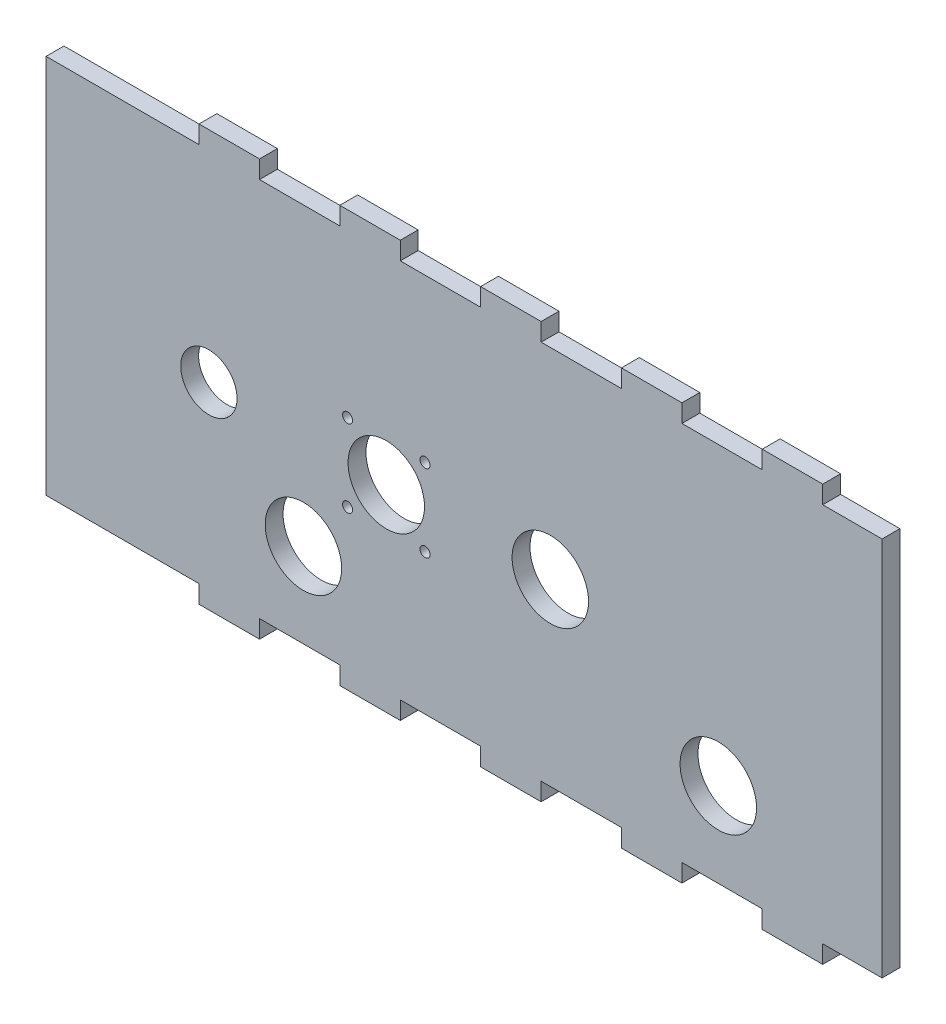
ISO-10303-21;
HEADER;
FILE_DESCRIPTION(('STEP AP214'),'2;1');
FILE_NAME('part.step','',(''),(''),'','','');
FILE_SCHEMA(('AUTOMOTIVE_DESIGN { 1 0 10303 214 1 1 1 1 }'));
ENDSEC;
DATA;
#1=APPLICATION_CONTEXT('core data for automotive mechanical design processes');
#2=APPLICATION_PROTOCOL_DEFINITION('international standard','automotive_design',2000,#1);
#3=PRODUCT_CONTEXT('',#1,'mechanical');
#4=PRODUCT('Part','Part','',(#3));
#5=PRODUCT_RELATED_PRODUCT_CATEGORY('part','',(#4));
#6=PRODUCT_DEFINITION_FORMATION('','',#4);
#7=PRODUCT_DEFINITION_CONTEXT('part definition',#1,'design');
#8=PRODUCT_DEFINITION('design','',#6,#7);
#9=PRODUCT_DEFINITION_SHAPE('','',#8);
#10=(LENGTH_UNIT() NAMED_UNIT(*) SI_UNIT(.MILLI.,.METRE.));
#11=(NAMED_UNIT(*) PLANE_ANGLE_UNIT() SI_UNIT($,.RADIAN.));
#12=(NAMED_UNIT(*) SI_UNIT($,.STERADIAN.) SOLID_ANGLE_UNIT());
#13=UNCERTAINTY_MEASURE_WITH_UNIT(LENGTH_MEASURE(1.E-05),#10,'distance_accuracy_value','');
#14=(GEOMETRIC_REPRESENTATION_CONTEXT(3) GLOBAL_UNCERTAINTY_ASSIGNED_CONTEXT((#13)) GLOBAL_UNIT_ASSIGNED_CONTEXT((#10,
#11,#12)) REPRESENTATION_CONTEXT('',''));
#15=CARTESIAN_POINT('',(0.,0.,0.));
#16=DIRECTION('',(0.,0.,1.));
#17=DIRECTION('',(1.,0.,0.));
#18=AXIS2_PLACEMENT_3D('',#15,#16,#17);
#19=CARTESIAN_POINT('',(0.,0.,6.35));
#20=DIRECTION('',(0.,0.,1.));
#21=DIRECTION('',(1.,0.,0.));
#22=AXIS2_PLACEMENT_3D('',#19,#20,#21);
#23=PLANE('',#22);
#24=CARTESIAN_POINT('',(134.557646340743,49.9216144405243,6.35));
#25=DIRECTION('',(0.,0.,1.));
#26=DIRECTION('',(1.,0.,0.));
#27=AXIS2_PLACEMENT_3D('',#24,#25,#26);
#28=CIRCLE('',#27,1.77800000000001);
#29=CARTESIAN_POINT('',(136.335646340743,49.9216144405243,6.35));
#30=VERTEX_POINT('',#29);
#31=EDGE_CURVE('E868',#30,#30,#28,.T.);
#32=ORIENTED_EDGE('',*,*,#31,.F.);
#33=EDGE_LOOP('',(#32));
#34=FACE_BOUND('',#33,.T.);
#35=CARTESIAN_POINT('',(107.06010209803,49.9216144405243,6.35));
#36=DIRECTION('',(0.,0.,1.));
#37=DIRECTION('',(1.,0.,0.));
#38=AXIS2_PLACEMENT_3D('',#35,#36,#37);
#39=CIRCLE('',#38,1.77800000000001);
#40=CARTESIAN_POINT('',(108.83810209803,49.9216144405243,6.35));
#41=VERTEX_POINT('',#40);
#42=EDGE_CURVE('E884',#41,#41,#39,.T.);
#43=ORIENTED_EDGE('',*,*,#42,.F.);
#44=EDGE_LOOP('',(#43));
#45=FACE_BOUND('',#44,.T.);
#46=CARTESIAN_POINT('',(120.808874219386,63.6703865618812,6.35));
#47=DIRECTION('',(0.,0.,1.));
#48=DIRECTION('',(1.,0.,0.));
#49=AXIS2_PLACEMENT_3D('',#46,#47,#48);
#50=CIRCLE('',#49,13.575);
#51=CARTESIAN_POINT('',(134.383874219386,63.6703865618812,6.35));
#52=VERTEX_POINT('',#51);
#53=EDGE_CURVE('E900',#52,#52,#50,.T.);
#54=ORIENTED_EDGE('',*,*,#53,.F.);
#55=EDGE_LOOP('',(#54));
#56=FACE_BOUND('',#55,.T.);
#57=CARTESIAN_POINT('',(238.7025,30.,6.35));
#58=DIRECTION('',(0.,0.,1.));
#59=DIRECTION('',(1.,0.,0.));
#60=AXIS2_PLACEMENT_3D('',#57,#58,#59);
#61=CIRCLE('',#60,13.575);
#62=CARTESIAN_POINT('',(252.2775,30.,6.35));
#63=VERTEX_POINT('',#62);
#64=EDGE_CURVE('E916',#63,#63,#61,.T.);
#65=ORIENTED_EDGE('',*,*,#64,.F.);
#66=EDGE_LOOP('',(#65));
#67=FACE_BOUND('',#66,.T.);
#68=DIRECTION('',(1.,0.,0.));
#69=VECTOR('',#68,1.);
#70=CARTESIAN_POINT('',(54.3,0.,6.35));
#71=LINE('',#70,#69);
#72=CARTESIAN_POINT('',(0.,0.,6.35));
#73=VERTEX_POINT('',#72);
#74=CARTESIAN_POINT('',(54.3,0.,6.35));
#75=VERTEX_POINT('',#74);
#76=EDGE_CURVE('E492',#73,#75,#71,.T.);
#77=ORIENTED_EDGE('',*,*,#76,.T.);
#78=DIRECTION('',(0.,-1.,0.));
#79=VECTOR('',#78,1.);
#80=CARTESIAN_POINT('',(54.3,-6.35,6.35));
#81=LINE('',#80,#79);
#82=CARTESIAN_POINT('',(54.3,-6.35,6.35));
#83=VERTEX_POINT('',#82);
#84=EDGE_CURVE('E212',#75,#83,#81,.T.);
#85=ORIENTED_EDGE('',*,*,#84,.T.);
#86=DIRECTION('',(1.,0.,0.));
#87=VECTOR('',#86,1.);
#88=CARTESIAN_POINT('',(75.785,-6.35,6.35));
#89=LINE('',#88,#87);
#90=CARTESIAN_POINT('',(75.785,-6.35,6.35));
#91=VERTEX_POINT('',#90);
#92=EDGE_CURVE('E657',#83,#91,#89,.T.);
#93=ORIENTED_EDGE('',*,*,#92,.T.);
#94=DIRECTION('',(0.,1.,0.));
#95=VECTOR('',#94,1.);
#96=CARTESIAN_POINT('',(75.7850000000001,0.,6.35));
#97=LINE('',#96,#95);
#98=CARTESIAN_POINT('',(75.7850000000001,0.,6.35));
#99=VERTEX_POINT('',#98);
#100=EDGE_CURVE('E677',#91,#99,#97,.T.);
#101=ORIENTED_EDGE('',*,*,#100,.T.);
#102=DIRECTION('',(1.,0.,0.));
#103=VECTOR('',#102,1.);
#104=CARTESIAN_POINT('',(104.3,0.,6.35));
#105=LINE('',#104,#103);
#106=CARTESIAN_POINT('',(104.3,0.,6.35));
#107=VERTEX_POINT('',#106);
#108=EDGE_CURVE('E673',#99,#107,#105,.T.);
#109=ORIENTED_EDGE('',*,*,#108,.T.);
#110=DIRECTION('',(0.,-1.,0.));
#111=VECTOR('',#110,1.);
#112=CARTESIAN_POINT('',(104.3,-6.34999999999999,6.35));
#113=LINE('',#112,#111);
#114=CARTESIAN_POINT('',(104.3,-6.34999999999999,6.35));
#115=VERTEX_POINT('',#114);
#116=EDGE_CURVE('E676',#107,#115,#113,.T.);
#117=ORIENTED_EDGE('',*,*,#116,.T.);
#118=DIRECTION('',(1.,0.,0.));
#119=VECTOR('',#118,1.);
#120=CARTESIAN_POINT('',(125.785,-6.34999999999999,6.35));
#121=LINE('',#120,#119);
#122=CARTESIAN_POINT('',(125.785,-6.34999999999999,6.35));
#123=VERTEX_POINT('',#122);
#124=EDGE_CURVE('E681',#115,#123,#121,.T.);
#125=ORIENTED_EDGE('',*,*,#124,.T.);
#126=DIRECTION('',(0.,1.,0.));
#127=VECTOR('',#126,1.);
#128=CARTESIAN_POINT('',(125.785,0.,6.35));
#129=LINE('',#128,#127);
#130=CARTESIAN_POINT('',(125.785,0.,6.35));
#131=VERTEX_POINT('',#130);
#132=EDGE_CURVE('E688',#123,#131,#129,.T.);
#133=ORIENTED_EDGE('',*,*,#132,.T.);
#134=DIRECTION('',(1.,0.,0.));
#135=VECTOR('',#134,1.);
#136=CARTESIAN_POINT('',(154.3,0.,6.35));
#137=LINE('',#136,#135);
#138=CARTESIAN_POINT('',(154.3,0.,6.35));
#139=VERTEX_POINT('',#138);
#140=EDGE_CURVE('E691',#131,#139,#137,.T.);
#141=ORIENTED_EDGE('',*,*,#140,.T.);
#142=DIRECTION('',(0.,-1.,0.));
#143=VECTOR('',#142,1.);
#144=CARTESIAN_POINT('',(154.3,0.,6.35));
#145=LINE('',#144,#143);
#146=CARTESIAN_POINT('',(154.3,-6.34999999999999,6.35));
#147=VERTEX_POINT('',#146);
#148=EDGE_CURVE('E694',#139,#147,#145,.T.);
#149=ORIENTED_EDGE('',*,*,#148,.T.);
#150=DIRECTION('',(1.,0.,0.));
#151=VECTOR('',#150,1.);
#152=CARTESIAN_POINT('',(154.3,-6.34999999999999,6.35));
#153=LINE('',#152,#151);
#154=CARTESIAN_POINT('',(175.785,-6.34999999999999,6.35));
#155=VERTEX_POINT('',#154);
#156=EDGE_CURVE('E697',#147,#155,#153,.T.);
#157=ORIENTED_EDGE('',*,*,#156,.T.);
#158=DIRECTION('',(0.,1.,0.));
#159=VECTOR('',#158,1.);
#160=CARTESIAN_POINT('',(175.785,-6.34999999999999,6.35));
#161=LINE('',#160,#159);
#162=CARTESIAN_POINT('',(175.785,0.,6.35));
#163=VERTEX_POINT('',#162);
#164=EDGE_CURVE('E700',#155,#163,#161,.T.);
#165=ORIENTED_EDGE('',*,*,#164,.T.);
#166=DIRECTION('',(1.,0.,0.));
#167=VECTOR('',#166,1.);
#168=CARTESIAN_POINT('',(175.785,0.,6.35));
#169=LINE('',#168,#167);
#170=CARTESIAN_POINT('',(204.3,0.,6.35));
#171=VERTEX_POINT('',#170);
#172=EDGE_CURVE('E703',#163,#171,#169,.T.);
#173=ORIENTED_EDGE('',*,*,#172,.T.);
#174=DIRECTION('',(0.,-1.,0.));
#175=VECTOR('',#174,1.);
#176=CARTESIAN_POINT('',(204.3,0.,6.35));
#177=LINE('',#176,#175);
#178=CARTESIAN_POINT('',(204.3,-6.35,6.35));
#179=VERTEX_POINT('',#178);
#180=EDGE_CURVE('E706',#171,#179,#177,.T.);
#181=ORIENTED_EDGE('',*,*,#180,.T.);
#182=DIRECTION('',(1.,0.,0.));
#183=VECTOR('',#182,1.);
#184=CARTESIAN_POINT('',(204.3,-6.35,6.35));
#185=LINE('',#184,#183);
#186=CARTESIAN_POINT('',(225.785,-6.35000000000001,6.35));
#187=VERTEX_POINT('',#186);
#188=EDGE_CURVE('E709',#179,#187,#185,.T.);
#189=ORIENTED_EDGE('',*,*,#188,.T.);
#190=DIRECTION('',(0.,1.,0.));
#191=VECTOR('',#190,1.);
#192=CARTESIAN_POINT('',(225.785,-6.35000000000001,6.35));
#193=LINE('',#192,#191);
#194=CARTESIAN_POINT('',(225.785,0.,6.35));
#195=VERTEX_POINT('',#194);
#196=EDGE_CURVE('E712',#187,#195,#193,.T.);
#197=ORIENTED_EDGE('',*,*,#196,.T.);
#198=DIRECTION('',(1.,0.,0.));
#199=VECTOR('',#198,1.);
#200=CARTESIAN_POINT('',(225.785,0.,6.35));
#201=LINE('',#200,#199);
#202=CARTESIAN_POINT('',(254.3,0.,6.35));
#203=VERTEX_POINT('',#202);
#204=EDGE_CURVE('E715',#195,#203,#201,.T.);
#205=ORIENTED_EDGE('',*,*,#204,.T.);
#206=DIRECTION('',(0.,-1.,0.));
#207=VECTOR('',#206,1.);
#208=CARTESIAN_POINT('',(254.3,0.,6.35));
#209=LINE('',#208,#207);
#210=CARTESIAN_POINT('',(254.3,-6.35000000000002,6.35));
#211=VERTEX_POINT('',#210);
#212=EDGE_CURVE('E718',#203,#211,#209,.T.);
#213=ORIENTED_EDGE('',*,*,#212,.T.);
#214=DIRECTION('',(1.,0.,0.));
#215=VECTOR('',#214,1.);
#216=CARTESIAN_POINT('',(254.3,-6.35000000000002,6.35));
#217=LINE('',#216,#215);
#218=CARTESIAN_POINT('',(275.785,-6.35000000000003,6.35));
#219=VERTEX_POINT('',#218);
#220=EDGE_CURVE('E721',#211,#219,#217,.T.);
#221=ORIENTED_EDGE('',*,*,#220,.T.);
#222=DIRECTION('',(0.,1.,0.));
#223=VECTOR('',#222,1.);
#224=CARTESIAN_POINT('',(275.785,-6.35000000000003,6.35));
#225=LINE('',#224,#223);
#226=CARTESIAN_POINT('',(275.785,0.,6.35));
#227=VERTEX_POINT('',#226);
#228=EDGE_CURVE('E724',#219,#227,#225,.T.);
#229=ORIENTED_EDGE('',*,*,#228,.T.);
#230=DIRECTION('',(1.,0.,0.));
#231=VECTOR('',#230,1.);
#232=CARTESIAN_POINT('',(275.785,0.,6.35));
#233=LINE('',#232,#231);
#234=CARTESIAN_POINT('',(296.845,0.,6.35));
#235=VERTEX_POINT('',#234);
#236=EDGE_CURVE('E727',#227,#235,#233,.T.);
#237=ORIENTED_EDGE('',*,*,#236,.T.);
#238=DIRECTION('',(0.,1.,0.));
#239=VECTOR('',#238,1.);
#240=CARTESIAN_POINT('',(296.845,135.,6.35));
#241=LINE('',#240,#239);
#242=CARTESIAN_POINT('',(296.845,135.,6.35));
#243=VERTEX_POINT('',#242);
#244=EDGE_CURVE('E730',#235,#243,#241,.T.);
#245=ORIENTED_EDGE('',*,*,#244,.T.);
#246=DIRECTION('',(-1.,0.,0.));
#247=VECTOR('',#246,1.);
#248=CARTESIAN_POINT('',(275.785,135.,6.35));
#249=LINE('',#248,#247);
#250=CARTESIAN_POINT('',(275.785,135.,6.35));
#251=VERTEX_POINT('',#250);
#252=EDGE_CURVE('E733',#243,#251,#249,.T.);
#253=ORIENTED_EDGE('',*,*,#252,.T.);
#254=DIRECTION('',(0.,1.,0.));
#255=VECTOR('',#254,1.);
#256=CARTESIAN_POINT('',(275.785,141.35,6.35));
#257=LINE('',#256,#255);
#258=CARTESIAN_POINT('',(275.785,141.35,6.35));
#259=VERTEX_POINT('',#258);
#260=EDGE_CURVE('E736',#251,#259,#257,.T.);
#261=ORIENTED_EDGE('',*,*,#260,.T.);
#262=DIRECTION('',(-1.,0.,0.));
#263=VECTOR('',#262,1.);
#264=CARTESIAN_POINT('',(254.3,141.35,6.35));
#265=LINE('',#264,#263);
#266=CARTESIAN_POINT('',(254.3,141.35,6.35));
#267=VERTEX_POINT('',#266);
#268=EDGE_CURVE('E739',#259,#267,#265,.T.);
#269=ORIENTED_EDGE('',*,*,#268,.T.);
#270=DIRECTION('',(0.,-1.,0.));
#271=VECTOR('',#270,1.);
#272=CARTESIAN_POINT('',(254.3,135.,6.35));
#273=LINE('',#272,#271);
#274=CARTESIAN_POINT('',(254.3,135.,6.35));
#275=VERTEX_POINT('',#274);
#276=EDGE_CURVE('E742',#267,#275,#273,.T.);
#277=ORIENTED_EDGE('',*,*,#276,.T.);
#278=DIRECTION('',(-1.,0.,0.));
#279=VECTOR('',#278,1.);
#280=CARTESIAN_POINT('',(225.785,135.,6.35));
#281=LINE('',#280,#279);
#282=CARTESIAN_POINT('',(225.785,135.,6.35));
#283=VERTEX_POINT('',#282);
#284=EDGE_CURVE('E745',#275,#283,#281,.T.);
#285=ORIENTED_EDGE('',*,*,#284,.T.);
#286=DIRECTION('',(0.,1.,0.));
#287=VECTOR('',#286,1.);
#288=CARTESIAN_POINT('',(225.785,141.35,6.35));
#289=LINE('',#288,#287);
#290=CARTESIAN_POINT('',(225.785,141.35,6.35));
#291=VERTEX_POINT('',#290);
#292=EDGE_CURVE('E748',#283,#291,#289,.T.);
#293=ORIENTED_EDGE('',*,*,#292,.T.);
#294=DIRECTION('',(-1.,0.,0.));
#295=VECTOR('',#294,1.);
#296=CARTESIAN_POINT('',(204.3,141.35,6.35));
#297=LINE('',#296,#295);
#298=CARTESIAN_POINT('',(204.3,141.35,6.35));
#299=VERTEX_POINT('',#298);
#300=EDGE_CURVE('E751',#291,#299,#297,.T.);
#301=ORIENTED_EDGE('',*,*,#300,.T.);
#302=DIRECTION('',(0.,-1.,0.));
#303=VECTOR('',#302,1.);
#304=CARTESIAN_POINT('',(204.3,135.,6.35));
#305=LINE('',#304,#303);
#306=CARTESIAN_POINT('',(204.3,135.,6.35));
#307=VERTEX_POINT('',#306);
#308=EDGE_CURVE('E754',#299,#307,#305,.T.);
#309=ORIENTED_EDGE('',*,*,#308,.T.);
#310=DIRECTION('',(-1.,0.,0.));
#311=VECTOR('',#310,1.);
#312=CARTESIAN_POINT('',(175.785,135.,6.35));
#313=LINE('',#312,#311);
#314=CARTESIAN_POINT('',(175.785,135.,6.35));
#315=VERTEX_POINT('',#314);
#316=EDGE_CURVE('E757',#307,#315,#313,.T.);
#317=ORIENTED_EDGE('',*,*,#316,.T.);
#318=DIRECTION('',(0.,1.,0.));
#319=VECTOR('',#318,1.);
#320=CARTESIAN_POINT('',(175.785,141.35,6.35));
#321=LINE('',#320,#319);
#322=CARTESIAN_POINT('',(175.785,141.35,6.35));
#323=VERTEX_POINT('',#322);
#324=EDGE_CURVE('E760',#315,#323,#321,.T.);
#325=ORIENTED_EDGE('',*,*,#324,.T.);
#326=DIRECTION('',(-1.,0.,0.));
#327=VECTOR('',#326,1.);
#328=CARTESIAN_POINT('',(154.3,141.35,6.35));
#329=LINE('',#328,#327);
#330=CARTESIAN_POINT('',(154.3,141.35,6.35));
#331=VERTEX_POINT('',#330);
#332=EDGE_CURVE('E763',#323,#331,#329,.T.);
#333=ORIENTED_EDGE('',*,*,#332,.T.);
#334=DIRECTION('',(0.,-1.,0.));
#335=VECTOR('',#334,1.);
#336=CARTESIAN_POINT('',(154.3,135.,6.35));
#337=LINE('',#336,#335);
#338=CARTESIAN_POINT('',(154.3,135.,6.35));
#339=VERTEX_POINT('',#338);
#340=EDGE_CURVE('E766',#331,#339,#337,.T.);
#341=ORIENTED_EDGE('',*,*,#340,.T.);
#342=DIRECTION('',(-1.,0.,0.));
#343=VECTOR('',#342,1.);
#344=CARTESIAN_POINT('',(154.3,135.,6.35));
#345=LINE('',#344,#343);
#346=CARTESIAN_POINT('',(125.785,135.,6.35));
#347=VERTEX_POINT('',#346);
#348=EDGE_CURVE('E769',#339,#347,#345,.T.);
#349=ORIENTED_EDGE('',*,*,#348,.T.);
#350=DIRECTION('',(0.,1.,0.));
#351=VECTOR('',#350,1.);
#352=CARTESIAN_POINT('',(125.785,135.,6.35));
#353=LINE('',#352,#351);
#354=CARTESIAN_POINT('',(125.785,141.35,6.35));
#355=VERTEX_POINT('',#354);
#356=EDGE_CURVE('E772',#347,#355,#353,.T.);
#357=ORIENTED_EDGE('',*,*,#356,.T.);
#358=DIRECTION('',(-1.,0.,0.));
#359=VECTOR('',#358,1.);
#360=CARTESIAN_POINT('',(125.785,141.35,6.35));
#361=LINE('',#360,#359);
#362=CARTESIAN_POINT('',(104.3,141.35,6.35));
#363=VERTEX_POINT('',#362);
#364=EDGE_CURVE('E775',#355,#363,#361,.T.);
#365=ORIENTED_EDGE('',*,*,#364,.T.);
#366=DIRECTION('',(0.,-1.,0.));
#367=VECTOR('',#366,1.);
#368=CARTESIAN_POINT('',(104.3,141.35,6.35));
#369=LINE('',#368,#367);
#370=CARTESIAN_POINT('',(104.3,135.,6.35));
#371=VERTEX_POINT('',#370);
#372=EDGE_CURVE('E778',#363,#371,#369,.T.);
#373=ORIENTED_EDGE('',*,*,#372,.T.);
#374=DIRECTION('',(-1.,0.,0.));
#375=VECTOR('',#374,1.);
#376=CARTESIAN_POINT('',(104.3,135.,6.35));
#377=LINE('',#376,#375);
#378=CARTESIAN_POINT('',(75.7850000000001,135.,6.35));
#379=VERTEX_POINT('',#378);
#380=EDGE_CURVE('E781',#371,#379,#377,.T.);
#381=ORIENTED_EDGE('',*,*,#380,.T.);
#382=DIRECTION('',(0.,1.,0.));
#383=VECTOR('',#382,1.);
#384=CARTESIAN_POINT('',(75.7850000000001,135.,6.35));
#385=LINE('',#384,#383);
#386=CARTESIAN_POINT('',(75.785,141.35,6.35));
#387=VERTEX_POINT('',#386);
#388=EDGE_CURVE('E784',#379,#387,#385,.T.);
#389=ORIENTED_EDGE('',*,*,#388,.T.);
#390=DIRECTION('',(-1.,0.,0.));
#391=VECTOR('',#390,1.);
#392=CARTESIAN_POINT('',(75.785,141.35,6.35));
#393=LINE('',#392,#391);
#394=CARTESIAN_POINT('',(54.3,141.35,6.35));
#395=VERTEX_POINT('',#394);
#396=EDGE_CURVE('E339',#387,#395,#393,.T.);
#397=ORIENTED_EDGE('',*,*,#396,.T.);
#398=DIRECTION('',(0.,-1.,0.));
#399=VECTOR('',#398,1.);
#400=CARTESIAN_POINT('',(54.3,141.35,6.35));
#401=LINE('',#400,#399);
#402=CARTESIAN_POINT('',(54.3,135.,6.35));
#403=VERTEX_POINT('',#402);
#404=EDGE_CURVE('E333',#395,#403,#401,.T.);
#405=ORIENTED_EDGE('',*,*,#404,.T.);
#406=DIRECTION('',(-1.,0.,0.));
#407=VECTOR('',#406,1.);
#408=CARTESIAN_POINT('',(54.3,135.,6.35));
#409=LINE('',#408,#407);
#410=CARTESIAN_POINT('',(0.,135.,6.35));
#411=VERTEX_POINT('',#410);
#412=EDGE_CURVE('E337',#403,#411,#409,.T.);
#413=ORIENTED_EDGE('',*,*,#412,.T.);
#414=DIRECTION('',(0.,-1.,0.));
#415=VECTOR('',#414,1.);
#416=CARTESIAN_POINT('',(0.,135.,6.35));
#417=LINE('',#416,#415);
#418=EDGE_CURVE('E61',#411,#73,#417,.T.);
#419=ORIENTED_EDGE('',*,*,#418,.T.);
#420=EDGE_LOOP('',(#77,#85,#93,#101,#109,#117,#125,#133,#141,#149,#157,#165,#173,#181,#189,#197,
#205,#213,#221,#229,#237,#245,#253,#261,#269,#277,#285,#293,#301,#309,#317,#325,#333,#341,#349,
#357,#365,#373,#381,#389,#397,#405,#413,#419));
#421=FACE_BOUND('',#420,.T.);
#422=CARTESIAN_POINT('',(91.3825000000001,30.,6.35));
#423=DIRECTION('',(0.,0.,1.));
#424=DIRECTION('',(1.,0.,0.));
#425=AXIS2_PLACEMENT_3D('',#422,#423,#424);
#426=CIRCLE('',#425,13.575);
#427=CARTESIAN_POINT('',(104.9575,30.,6.35));
#428=VERTEX_POINT('',#427);
#429=EDGE_CURVE('E366',#428,#428,#426,.T.);
#430=ORIENTED_EDGE('',*,*,#429,.F.);
#431=EDGE_LOOP('',(#430));
#432=FACE_BOUND('',#431,.T.);
#433=CARTESIAN_POINT('',(179.048874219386,63.6703865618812,6.35));
#434=DIRECTION('',(0.,0.,1.));
#435=DIRECTION('',(1.,0.,0.));
#436=AXIS2_PLACEMENT_3D('',#433,#434,#435);
#437=CIRCLE('',#436,13.575);
#438=CARTESIAN_POINT('',(192.623874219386,63.6703865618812,6.35));
#439=VERTEX_POINT('',#438);
#440=EDGE_CURVE('E908',#439,#439,#437,.T.);
#441=ORIENTED_EDGE('',*,*,#440,.F.);
#442=EDGE_LOOP('',(#441));
#443=FACE_BOUND('',#442,.T.);
#444=CARTESIAN_POINT('',(107.06010209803,77.4191586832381,6.35));
#445=DIRECTION('',(0.,0.,1.));
#446=DIRECTION('',(1.,0.,0.));
#447=AXIS2_PLACEMENT_3D('',#444,#445,#446);
#448=CIRCLE('',#447,1.778);
#449=CARTESIAN_POINT('',(108.83810209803,77.4191586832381,6.35));
#450=VERTEX_POINT('',#449);
#451=EDGE_CURVE('E892',#450,#450,#448,.T.);
#452=ORIENTED_EDGE('',*,*,#451,.F.);
#453=EDGE_LOOP('',(#452));
#454=FACE_BOUND('',#453,.T.);
#455=CARTESIAN_POINT('',(134.557646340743,77.4191586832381,6.35));
#456=DIRECTION('',(0.,0.,1.));
#457=DIRECTION('',(1.,0.,0.));
#458=AXIS2_PLACEMENT_3D('',#455,#456,#457);
#459=CIRCLE('',#458,1.778);
#460=CARTESIAN_POINT('',(136.335646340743,77.4191586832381,6.35));
#461=VERTEX_POINT('',#460);
#462=EDGE_CURVE('E876',#461,#461,#459,.T.);
#463=ORIENTED_EDGE('',*,*,#462,.F.);
#464=EDGE_LOOP('',(#463));
#465=FACE_BOUND('',#464,.T.);
#466=CARTESIAN_POINT('',(57.8088742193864,63.6703865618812,6.35));
#467=DIRECTION('',(0.,0.,1.));
#468=DIRECTION('',(1.,0.,0.));
#469=AXIS2_PLACEMENT_3D('',#466,#467,#468);
#470=CIRCLE('',#469,9.99999999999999);
#471=CARTESIAN_POINT('',(67.8088742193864,63.6703865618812,6.35));
#472=VERTEX_POINT('',#471);
#473=EDGE_CURVE('E857',#472,#472,#470,.T.);
#474=ORIENTED_EDGE('',*,*,#473,.F.);
#475=EDGE_LOOP('',(#474));
#476=FACE_BOUND('',#475,.T.);
#477=ADVANCED_FACE('F43',(#34,#45,#56,#67,#421,#432,#443,#454,#465,#476),#23,.T.);
#478=CARTESIAN_POINT('',(0.,0.,0.));
#479=DIRECTION('',(0.,0.,1.));
#480=DIRECTION('',(1.,0.,0.));
#481=AXIS2_PLACEMENT_3D('',#478,#479,#480);
#482=PLANE('',#481);
#483=DIRECTION('',(1.,0.,0.));
#484=VECTOR('',#483,1.);
#485=CARTESIAN_POINT('',(54.3,0.,0.));
#486=LINE('',#485,#484);
#487=CARTESIAN_POINT('',(0.,0.,0.));
#488=VERTEX_POINT('',#487);
#489=CARTESIAN_POINT('',(54.3,0.,0.));
#490=VERTEX_POINT('',#489);
#491=EDGE_CURVE('E361',#488,#490,#486,.T.);
#492=ORIENTED_EDGE('',*,*,#491,.F.);
#493=DIRECTION('',(0.,-1.,0.));
#494=VECTOR('',#493,1.);
#495=CARTESIAN_POINT('',(0.,135.,0.));
#496=LINE('',#495,#494);
#497=CARTESIAN_POINT('',(0.,135.,0.));
#498=VERTEX_POINT('',#497);
#499=EDGE_CURVE('E204',#498,#488,#496,.T.);
#500=ORIENTED_EDGE('',*,*,#499,.F.);
#501=DIRECTION('',(-1.,0.,0.));
#502=VECTOR('',#501,1.);
#503=CARTESIAN_POINT('',(54.3,135.,0.));
#504=LINE('',#503,#502);
#505=CARTESIAN_POINT('',(54.3,135.,0.));
#506=VERTEX_POINT('',#505);
#507=EDGE_CURVE('E198',#506,#498,#504,.T.);
#508=ORIENTED_EDGE('',*,*,#507,.F.);
#509=DIRECTION('',(0.,-1.,0.));
#510=VECTOR('',#509,1.);
#511=CARTESIAN_POINT('',(54.3,141.35,0.));
#512=LINE('',#511,#510);
#513=CARTESIAN_POINT('',(54.3,141.35,0.));
#514=VERTEX_POINT('',#513);
#515=EDGE_CURVE('E348',#514,#506,#512,.T.);
#516=ORIENTED_EDGE('',*,*,#515,.F.);
#517=DIRECTION('',(-1.,0.,0.));
#518=VECTOR('',#517,1.);
#519=CARTESIAN_POINT('',(75.785,141.35,0.));
#520=LINE('',#519,#518);
#521=CARTESIAN_POINT('',(75.785,141.35,0.));
#522=VERTEX_POINT('',#521);
#523=EDGE_CURVE('E483',#522,#514,#520,.T.);
#524=ORIENTED_EDGE('',*,*,#523,.F.);
#525=DIRECTION('',(0.,1.,0.));
#526=VECTOR('',#525,1.);
#527=CARTESIAN_POINT('',(75.7850000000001,135.,0.));
#528=LINE('',#527,#526);
#529=CARTESIAN_POINT('',(75.7850000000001,135.,0.));
#530=VERTEX_POINT('',#529);
#531=EDGE_CURVE('E480',#530,#522,#528,.T.);
#532=ORIENTED_EDGE('',*,*,#531,.F.);
#533=DIRECTION('',(-1.,0.,0.));
#534=VECTOR('',#533,1.);
#535=CARTESIAN_POINT('',(104.3,135.,0.));
#536=LINE('',#535,#534);
#537=CARTESIAN_POINT('',(104.3,135.,0.));
#538=VERTEX_POINT('',#537);
#539=EDGE_CURVE('E477',#538,#530,#536,.T.);
#540=ORIENTED_EDGE('',*,*,#539,.F.);
#541=DIRECTION('',(0.,-1.,0.));
#542=VECTOR('',#541,1.);
#543=CARTESIAN_POINT('',(104.3,141.35,0.));
#544=LINE('',#543,#542);
#545=CARTESIAN_POINT('',(104.3,141.35,0.));
#546=VERTEX_POINT('',#545);
#547=EDGE_CURVE('E474',#546,#538,#544,.T.);
#548=ORIENTED_EDGE('',*,*,#547,.F.);
#549=DIRECTION('',(-1.,0.,0.));
#550=VECTOR('',#549,1.);
#551=CARTESIAN_POINT('',(125.785,141.35,0.));
#552=LINE('',#551,#550);
#553=CARTESIAN_POINT('',(125.785,141.35,0.));
#554=VERTEX_POINT('',#553);
#555=EDGE_CURVE('E471',#554,#546,#552,.T.);
#556=ORIENTED_EDGE('',*,*,#555,.F.);
#557=DIRECTION('',(0.,1.,0.));
#558=VECTOR('',#557,1.);
#559=CARTESIAN_POINT('',(125.785,135.,0.));
#560=LINE('',#559,#558);
#561=CARTESIAN_POINT('',(125.785,135.,0.));
#562=VERTEX_POINT('',#561);
#563=EDGE_CURVE('E468',#562,#554,#560,.T.);
#564=ORIENTED_EDGE('',*,*,#563,.F.);
#565=DIRECTION('',(-1.,0.,0.));
#566=VECTOR('',#565,1.);
#567=CARTESIAN_POINT('',(154.3,135.,0.));
#568=LINE('',#567,#566);
#569=CARTESIAN_POINT('',(154.3,135.,0.));
#570=VERTEX_POINT('',#569);
#571=EDGE_CURVE('E465',#570,#562,#568,.T.);
#572=ORIENTED_EDGE('',*,*,#571,.F.);
#573=DIRECTION('',(0.,-1.,0.));
#574=VECTOR('',#573,1.);
#575=CARTESIAN_POINT('',(154.3,135.,0.));
#576=LINE('',#575,#574);
#577=CARTESIAN_POINT('',(154.3,141.35,0.));
#578=VERTEX_POINT('',#577);
#579=EDGE_CURVE('E462',#578,#570,#576,.T.);
#580=ORIENTED_EDGE('',*,*,#579,.F.);
#581=DIRECTION('',(-1.,0.,0.));
#582=VECTOR('',#581,1.);
#583=CARTESIAN_POINT('',(154.3,141.35,0.));
#584=LINE('',#583,#582);
#585=CARTESIAN_POINT('',(175.785,141.35,0.));
#586=VERTEX_POINT('',#585);
#587=EDGE_CURVE('E459',#586,#578,#584,.T.);
#588=ORIENTED_EDGE('',*,*,#587,.F.);
#589=DIRECTION('',(0.,1.,0.));
#590=VECTOR('',#589,1.);
#591=CARTESIAN_POINT('',(175.785,141.35,0.));
#592=LINE('',#591,#590);
#593=CARTESIAN_POINT('',(175.785,135.,0.));
#594=VERTEX_POINT('',#593);
#595=EDGE_CURVE('E456',#594,#586,#592,.T.);
#596=ORIENTED_EDGE('',*,*,#595,.F.);
#597=DIRECTION('',(-1.,0.,0.));
#598=VECTOR('',#597,1.);
#599=CARTESIAN_POINT('',(175.785,135.,0.));
#600=LINE('',#599,#598);
#601=CARTESIAN_POINT('',(204.3,135.,0.));
#602=VERTEX_POINT('',#601);
#603=EDGE_CURVE('E453',#602,#594,#600,.T.);
#604=ORIENTED_EDGE('',*,*,#603,.F.);
#605=DIRECTION('',(0.,-1.,0.));
#606=VECTOR('',#605,1.);
#607=CARTESIAN_POINT('',(204.3,135.,0.));
#608=LINE('',#607,#606);
#609=CARTESIAN_POINT('',(204.3,141.35,0.));
#610=VERTEX_POINT('',#609);
#611=EDGE_CURVE('E450',#610,#602,#608,.T.);
#612=ORIENTED_EDGE('',*,*,#611,.F.);
#613=DIRECTION('',(-1.,0.,0.));
#614=VECTOR('',#613,1.);
#615=CARTESIAN_POINT('',(204.3,141.35,0.));
#616=LINE('',#615,#614);
#617=CARTESIAN_POINT('',(225.785,141.35,0.));
#618=VERTEX_POINT('',#617);
#619=EDGE_CURVE('E447',#618,#610,#616,.T.);
#620=ORIENTED_EDGE('',*,*,#619,.F.);
#621=DIRECTION('',(0.,1.,0.));
#622=VECTOR('',#621,1.);
#623=CARTESIAN_POINT('',(225.785,141.35,0.));
#624=LINE('',#623,#622);
#625=CARTESIAN_POINT('',(225.785,135.,0.));
#626=VERTEX_POINT('',#625);
#627=EDGE_CURVE('E444',#626,#618,#624,.T.);
#628=ORIENTED_EDGE('',*,*,#627,.F.);
#629=DIRECTION('',(-1.,0.,0.));
#630=VECTOR('',#629,1.);
#631=CARTESIAN_POINT('',(225.785,135.,0.));
#632=LINE('',#631,#630);
#633=CARTESIAN_POINT('',(254.3,135.,0.));
#634=VERTEX_POINT('',#633);
#635=EDGE_CURVE('E441',#634,#626,#632,.T.);
#636=ORIENTED_EDGE('',*,*,#635,.F.);
#637=DIRECTION('',(0.,-1.,0.));
#638=VECTOR('',#637,1.);
#639=CARTESIAN_POINT('',(254.3,135.,0.));
#640=LINE('',#639,#638);
#641=CARTESIAN_POINT('',(254.3,141.35,0.));
#642=VERTEX_POINT('',#641);
#643=EDGE_CURVE('E438',#642,#634,#640,.T.);
#644=ORIENTED_EDGE('',*,*,#643,.F.);
#645=DIRECTION('',(-1.,0.,0.));
#646=VECTOR('',#645,1.);
#647=CARTESIAN_POINT('',(254.3,141.35,0.));
#648=LINE('',#647,#646);
#649=CARTESIAN_POINT('',(275.785,141.35,0.));
#650=VERTEX_POINT('',#649);
#651=EDGE_CURVE('E435',#650,#642,#648,.T.);
#652=ORIENTED_EDGE('',*,*,#651,.F.);
#653=DIRECTION('',(0.,1.,0.));
#654=VECTOR('',#653,1.);
#655=CARTESIAN_POINT('',(275.785,141.35,0.));
#656=LINE('',#655,#654);
#657=CARTESIAN_POINT('',(275.785,135.,0.));
#658=VERTEX_POINT('',#657);
#659=EDGE_CURVE('E432',#658,#650,#656,.T.);
#660=ORIENTED_EDGE('',*,*,#659,.F.);
#661=DIRECTION('',(-1.,0.,0.));
#662=VECTOR('',#661,1.);
#663=CARTESIAN_POINT('',(275.785,135.,0.));
#664=LINE('',#663,#662);
#665=CARTESIAN_POINT('',(296.845,135.,0.));
#666=VERTEX_POINT('',#665);
#667=EDGE_CURVE('E429',#666,#658,#664,.T.);
#668=ORIENTED_EDGE('',*,*,#667,.F.);
#669=DIRECTION('',(0.,1.,0.));
#670=VECTOR('',#669,1.);
#671=CARTESIAN_POINT('',(296.845,135.,0.));
#672=LINE('',#671,#670);
#673=CARTESIAN_POINT('',(296.845,0.,0.));
#674=VERTEX_POINT('',#673);
#675=EDGE_CURVE('E426',#674,#666,#672,.T.);
#676=ORIENTED_EDGE('',*,*,#675,.F.);
#677=DIRECTION('',(1.,0.,0.));
#678=VECTOR('',#677,1.);
#679=CARTESIAN_POINT('',(275.785,0.,0.));
#680=LINE('',#679,#678);
#681=CARTESIAN_POINT('',(275.785,0.,0.));
#682=VERTEX_POINT('',#681);
#683=EDGE_CURVE('E423',#682,#674,#680,.T.);
#684=ORIENTED_EDGE('',*,*,#683,.F.);
#685=DIRECTION('',(0.,1.,0.));
#686=VECTOR('',#685,1.);
#687=CARTESIAN_POINT('',(275.785,-6.35000000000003,0.));
#688=LINE('',#687,#686);
#689=CARTESIAN_POINT('',(275.785,-6.35000000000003,0.));
#690=VERTEX_POINT('',#689);
#691=EDGE_CURVE('E420',#690,#682,#688,.T.);
#692=ORIENTED_EDGE('',*,*,#691,.F.);
#693=DIRECTION('',(1.,0.,0.));
#694=VECTOR('',#693,1.);
#695=CARTESIAN_POINT('',(254.3,-6.35000000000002,0.));
#696=LINE('',#695,#694);
#697=CARTESIAN_POINT('',(254.3,-6.35000000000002,0.));
#698=VERTEX_POINT('',#697);
#699=EDGE_CURVE('E417',#698,#690,#696,.T.);
#700=ORIENTED_EDGE('',*,*,#699,.F.);
#701=DIRECTION('',(0.,-1.,0.));
#702=VECTOR('',#701,1.);
#703=CARTESIAN_POINT('',(254.3,0.,0.));
#704=LINE('',#703,#702);
#705=CARTESIAN_POINT('',(254.3,0.,0.));
#706=VERTEX_POINT('',#705);
#707=EDGE_CURVE('E414',#706,#698,#704,.T.);
#708=ORIENTED_EDGE('',*,*,#707,.F.);
#709=DIRECTION('',(1.,0.,0.));
#710=VECTOR('',#709,1.);
#711=CARTESIAN_POINT('',(225.785,0.,0.));
#712=LINE('',#711,#710);
#713=CARTESIAN_POINT('',(225.785,0.,0.));
#714=VERTEX_POINT('',#713);
#715=EDGE_CURVE('E411',#714,#706,#712,.T.);
#716=ORIENTED_EDGE('',*,*,#715,.F.);
#717=DIRECTION('',(0.,1.,0.));
#718=VECTOR('',#717,1.);
#719=CARTESIAN_POINT('',(225.785,-6.35000000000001,0.));
#720=LINE('',#719,#718);
#721=CARTESIAN_POINT('',(225.785,-6.35000000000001,0.));
#722=VERTEX_POINT('',#721);
#723=EDGE_CURVE('E408',#722,#714,#720,.T.);
#724=ORIENTED_EDGE('',*,*,#723,.F.);
#725=DIRECTION('',(1.,0.,0.));
#726=VECTOR('',#725,1.);
#727=CARTESIAN_POINT('',(204.3,-6.35,0.));
#728=LINE('',#727,#726);
#729=CARTESIAN_POINT('',(204.3,-6.35,0.));
#730=VERTEX_POINT('',#729);
#731=EDGE_CURVE('E405',#730,#722,#728,.T.);
#732=ORIENTED_EDGE('',*,*,#731,.F.);
#733=DIRECTION('',(0.,-1.,0.));
#734=VECTOR('',#733,1.);
#735=CARTESIAN_POINT('',(204.3,0.,0.));
#736=LINE('',#735,#734);
#737=CARTESIAN_POINT('',(204.3,0.,0.));
#738=VERTEX_POINT('',#737);
#739=EDGE_CURVE('E402',#738,#730,#736,.T.);
#740=ORIENTED_EDGE('',*,*,#739,.F.);
#741=DIRECTION('',(1.,0.,0.));
#742=VECTOR('',#741,1.);
#743=CARTESIAN_POINT('',(175.785,0.,0.));
#744=LINE('',#743,#742);
#745=CARTESIAN_POINT('',(175.785,0.,0.));
#746=VERTEX_POINT('',#745);
#747=EDGE_CURVE('E399',#746,#738,#744,.T.);
#748=ORIENTED_EDGE('',*,*,#747,.F.);
#749=DIRECTION('',(0.,1.,0.));
#750=VECTOR('',#749,1.);
#751=CARTESIAN_POINT('',(175.785,-6.34999999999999,0.));
#752=LINE('',#751,#750);
#753=CARTESIAN_POINT('',(175.785,-6.34999999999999,0.));
#754=VERTEX_POINT('',#753);
#755=EDGE_CURVE('E396',#754,#746,#752,.T.);
#756=ORIENTED_EDGE('',*,*,#755,.F.);
#757=DIRECTION('',(1.,0.,0.));
#758=VECTOR('',#757,1.);
#759=CARTESIAN_POINT('',(154.3,-6.34999999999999,0.));
#760=LINE('',#759,#758);
#761=CARTESIAN_POINT('',(154.3,-6.34999999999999,0.));
#762=VERTEX_POINT('',#761);
#763=EDGE_CURVE('E393',#762,#754,#760,.T.);
#764=ORIENTED_EDGE('',*,*,#763,.F.);
#765=DIRECTION('',(0.,-1.,0.));
#766=VECTOR('',#765,1.);
#767=CARTESIAN_POINT('',(154.3,0.,0.));
#768=LINE('',#767,#766);
#769=CARTESIAN_POINT('',(154.3,0.,0.));
#770=VERTEX_POINT('',#769);
#771=EDGE_CURVE('E390',#770,#762,#768,.T.);
#772=ORIENTED_EDGE('',*,*,#771,.F.);
#773=DIRECTION('',(1.,0.,0.));
#774=VECTOR('',#773,1.);
#775=CARTESIAN_POINT('',(154.3,0.,0.));
#776=LINE('',#775,#774);
#777=CARTESIAN_POINT('',(125.785,0.,0.));
#778=VERTEX_POINT('',#777);
#779=EDGE_CURVE('E387',#778,#770,#776,.T.);
#780=ORIENTED_EDGE('',*,*,#779,.F.);
#781=DIRECTION('',(0.,1.,0.));
#782=VECTOR('',#781,1.);
#783=CARTESIAN_POINT('',(125.785,0.,0.));
#784=LINE('',#783,#782);
#785=CARTESIAN_POINT('',(125.785,-6.34999999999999,0.));
#786=VERTEX_POINT('',#785);
#787=EDGE_CURVE('E384',#786,#778,#784,.T.);
#788=ORIENTED_EDGE('',*,*,#787,.F.);
#789=DIRECTION('',(1.,0.,0.));
#790=VECTOR('',#789,1.);
#791=CARTESIAN_POINT('',(125.785,-6.34999999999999,0.));
#792=LINE('',#791,#790);
#793=CARTESIAN_POINT('',(104.3,-6.34999999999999,0.));
#794=VERTEX_POINT('',#793);
#795=EDGE_CURVE('E381',#794,#786,#792,.T.);
#796=ORIENTED_EDGE('',*,*,#795,.F.);
#797=DIRECTION('',(0.,-1.,0.));
#798=VECTOR('',#797,1.);
#799=CARTESIAN_POINT('',(104.3,-6.34999999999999,0.));
#800=LINE('',#799,#798);
#801=CARTESIAN_POINT('',(104.3,0.,0.));
#802=VERTEX_POINT('',#801);
#803=EDGE_CURVE('E378',#802,#794,#800,.T.);
#804=ORIENTED_EDGE('',*,*,#803,.F.);
#805=DIRECTION('',(1.,0.,0.));
#806=VECTOR('',#805,1.);
#807=CARTESIAN_POINT('',(104.3,0.,0.));
#808=LINE('',#807,#806);
#809=CARTESIAN_POINT('',(75.7850000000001,0.,0.));
#810=VERTEX_POINT('',#809);
#811=EDGE_CURVE('E375',#810,#802,#808,.T.);
#812=ORIENTED_EDGE('',*,*,#811,.F.);
#813=DIRECTION('',(0.,1.,0.));
#814=VECTOR('',#813,1.);
#815=CARTESIAN_POINT('',(75.7850000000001,0.,0.));
#816=LINE('',#815,#814);
#817=CARTESIAN_POINT('',(75.785,-6.35,0.));
#818=VERTEX_POINT('',#817);
#819=EDGE_CURVE('E372',#818,#810,#816,.T.);
#820=ORIENTED_EDGE('',*,*,#819,.F.);
#821=DIRECTION('',(1.,0.,0.));
#822=VECTOR('',#821,1.);
#823=CARTESIAN_POINT('',(75.785,-6.35,0.));
#824=LINE('',#823,#822);
#825=CARTESIAN_POINT('',(54.3,-6.35,0.));
#826=VERTEX_POINT('',#825);
#827=EDGE_CURVE('E369',#826,#818,#824,.T.);
#828=ORIENTED_EDGE('',*,*,#827,.F.);
#829=DIRECTION('',(0.,-1.,0.));
#830=VECTOR('',#829,1.);
#831=CARTESIAN_POINT('',(54.3,-6.35,0.));
#832=LINE('',#831,#830);
#833=EDGE_CURVE('E365',#490,#826,#832,.T.);
#834=ORIENTED_EDGE('',*,*,#833,.F.);
#835=EDGE_LOOP('',(#492,#500,#508,#516,#524,#532,#540,#548,#556,#564,#572,#580,#588,#596,#604,
#612,#620,#628,#636,#644,#652,#660,#668,#676,#684,#692,#700,#708,#716,#724,#732,#740,#748,#756,
#764,#772,#780,#788,#796,#804,#812,#820,#828,#834));
#836=FACE_BOUND('',#835,.T.);
#837=CARTESIAN_POINT('',(91.3825000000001,30.,0.));
#838=DIRECTION('',(0.,0.,1.));
#839=DIRECTION('',(1.,0.,0.));
#840=AXIS2_PLACEMENT_3D('',#837,#838,#839);
#841=CIRCLE('',#840,13.575);
#842=CARTESIAN_POINT('',(104.9575,30.,0.));
#843=VERTEX_POINT('',#842);
#844=EDGE_CURVE('E920',#843,#843,#841,.T.);
#845=ORIENTED_EDGE('',*,*,#844,.T.);
#846=EDGE_LOOP('',(#845));
#847=FACE_BOUND('',#846,.T.);
#848=CARTESIAN_POINT('',(238.7025,30.,0.));
#849=DIRECTION('',(0.,0.,1.));
#850=DIRECTION('',(1.,0.,0.));
#851=AXIS2_PLACEMENT_3D('',#848,#849,#850);
#852=CIRCLE('',#851,13.575);
#853=CARTESIAN_POINT('',(252.2775,30.,0.));
#854=VERTEX_POINT('',#853);
#855=EDGE_CURVE('E912',#854,#854,#852,.T.);
#856=ORIENTED_EDGE('',*,*,#855,.T.);
#857=EDGE_LOOP('',(#856));
#858=FACE_BOUND('',#857,.T.);
#859=CARTESIAN_POINT('',(179.048874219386,63.6703865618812,0.));
#860=DIRECTION('',(0.,0.,1.));
#861=DIRECTION('',(1.,0.,0.));
#862=AXIS2_PLACEMENT_3D('',#859,#860,#861);
#863=CIRCLE('',#862,13.575);
#864=CARTESIAN_POINT('',(192.623874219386,63.6703865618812,0.));
#865=VERTEX_POINT('',#864);
#866=EDGE_CURVE('E904',#865,#865,#863,.T.);
#867=ORIENTED_EDGE('',*,*,#866,.T.);
#868=EDGE_LOOP('',(#867));
#869=FACE_BOUND('',#868,.T.);
#870=CARTESIAN_POINT('',(120.808874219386,63.6703865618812,0.));
#871=DIRECTION('',(0.,0.,1.));
#872=DIRECTION('',(1.,0.,0.));
#873=AXIS2_PLACEMENT_3D('',#870,#871,#872);
#874=CIRCLE('',#873,13.575);
#875=CARTESIAN_POINT('',(134.383874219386,63.6703865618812,0.));
#876=VERTEX_POINT('',#875);
#877=EDGE_CURVE('E896',#876,#876,#874,.T.);
#878=ORIENTED_EDGE('',*,*,#877,.T.);
#879=EDGE_LOOP('',(#878));
#880=FACE_BOUND('',#879,.T.);
#881=CARTESIAN_POINT('',(107.06010209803,77.4191586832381,0.));
#882=DIRECTION('',(0.,0.,1.));
#883=DIRECTION('',(1.,0.,0.));
#884=AXIS2_PLACEMENT_3D('',#881,#882,#883);
#885=CIRCLE('',#884,1.778);
#886=CARTESIAN_POINT('',(108.83810209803,77.4191586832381,0.));
#887=VERTEX_POINT('',#886);
#888=EDGE_CURVE('E888',#887,#887,#885,.T.);
#889=ORIENTED_EDGE('',*,*,#888,.T.);
#890=EDGE_LOOP('',(#889));
#891=FACE_BOUND('',#890,.T.);
#892=CARTESIAN_POINT('',(107.06010209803,49.9216144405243,0.));
#893=DIRECTION('',(0.,0.,1.));
#894=DIRECTION('',(1.,0.,0.));
#895=AXIS2_PLACEMENT_3D('',#892,#893,#894);
#896=CIRCLE('',#895,1.77800000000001);
#897=CARTESIAN_POINT('',(108.83810209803,49.9216144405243,0.));
#898=VERTEX_POINT('',#897);
#899=EDGE_CURVE('E880',#898,#898,#896,.T.);
#900=ORIENTED_EDGE('',*,*,#899,.T.);
#901=EDGE_LOOP('',(#900));
#902=FACE_BOUND('',#901,.T.);
#903=CARTESIAN_POINT('',(134.557646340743,77.4191586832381,0.));
#904=DIRECTION('',(0.,0.,1.));
#905=DIRECTION('',(1.,0.,0.));
#906=AXIS2_PLACEMENT_3D('',#903,#904,#905);
#907=CIRCLE('',#906,1.778);
#908=CARTESIAN_POINT('',(136.335646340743,77.4191586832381,0.));
#909=VERTEX_POINT('',#908);
#910=EDGE_CURVE('E872',#909,#909,#907,.T.);
#911=ORIENTED_EDGE('',*,*,#910,.T.);
#912=EDGE_LOOP('',(#911));
#913=FACE_BOUND('',#912,.T.);
#914=CARTESIAN_POINT('',(134.557646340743,49.9216144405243,0.));
#915=DIRECTION('',(0.,0.,1.));
#916=DIRECTION('',(1.,0.,0.));
#917=AXIS2_PLACEMENT_3D('',#914,#915,#916);
#918=CIRCLE('',#917,1.77800000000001);
#919=CARTESIAN_POINT('',(136.335646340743,49.9216144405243,0.));
#920=VERTEX_POINT('',#919);
#921=EDGE_CURVE('E865',#920,#920,#918,.T.);
#922=ORIENTED_EDGE('',*,*,#921,.T.);
#923=EDGE_LOOP('',(#922));
#924=FACE_BOUND('',#923,.T.);
#925=CARTESIAN_POINT('',(57.8088742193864,63.6703865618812,0.));
#926=DIRECTION('',(0.,0.,1.));
#927=DIRECTION('',(1.,0.,0.));
#928=AXIS2_PLACEMENT_3D('',#925,#926,#927);
#929=CIRCLE('',#928,9.99999999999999);
#930=CARTESIAN_POINT('',(67.8088742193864,63.6703865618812,0.));
#931=VERTEX_POINT('',#930);
#932=EDGE_CURVE('E860',#931,#931,#929,.T.);
#933=ORIENTED_EDGE('',*,*,#932,.T.);
#934=EDGE_LOOP('',(#933));
#935=FACE_BOUND('',#934,.T.);
#936=ADVANCED_FACE('F661',(#836,#847,#858,#869,#880,#891,#902,#913,#924,#935),#482,.F.);
#937=CARTESIAN_POINT('',(54.3,0.,6.35));
#938=DIRECTION('',(0.,1.,0.));
#939=DIRECTION('',(0.,0.,1.));
#940=AXIS2_PLACEMENT_3D('',#937,#938,#939);
#941=PLANE('',#940);
#942=ORIENTED_EDGE('',*,*,#491,.T.);
#943=DIRECTION('',(0.,0.,-1.));
#944=VECTOR('',#943,1.);
#945=CARTESIAN_POINT('',(54.3,0.,6.35));
#946=LINE('',#945,#944);
#947=EDGE_CURVE('E11',#75,#490,#946,.T.);
#948=ORIENTED_EDGE('',*,*,#947,.F.);
#949=ORIENTED_EDGE('',*,*,#76,.F.);
#950=DIRECTION('',(0.,0.,-1.));
#951=VECTOR('',#950,1.);
#952=CARTESIAN_POINT('',(0.,0.,6.35));
#953=LINE('',#952,#951);
#954=EDGE_CURVE('E357',#73,#488,#953,.T.);
#955=ORIENTED_EDGE('',*,*,#954,.T.);
#956=EDGE_LOOP('',(#942,#948,#949,#955));
#957=FACE_BOUND('',#956,.T.);
#958=ADVANCED_FACE('F45',(#957),#941,.F.);
#959=CARTESIAN_POINT('',(54.3,-6.35,6.35));
#960=DIRECTION('',(1.,0.,0.));
#961=DIRECTION('',(0.,0.,-1.));
#962=AXIS2_PLACEMENT_3D('',#959,#960,#961);
#963=PLANE('',#962);
#964=ORIENTED_EDGE('',*,*,#833,.T.);
#965=DIRECTION('',(0.,0.,-1.));
#966=VECTOR('',#965,1.);
#967=CARTESIAN_POINT('',(54.3,-6.35,6.35));
#968=LINE('',#967,#966);
#969=EDGE_CURVE('E53',#83,#826,#968,.T.);
#970=ORIENTED_EDGE('',*,*,#969,.F.);
#971=ORIENTED_EDGE('',*,*,#84,.F.);
#972=ORIENTED_EDGE('',*,*,#947,.T.);
#973=EDGE_LOOP('',(#964,#970,#971,#972));
#974=FACE_BOUND('',#973,.T.);
#975=ADVANCED_FACE('F1443',(#974),#963,.F.);
#976=CARTESIAN_POINT('',(75.785,-6.35,6.35));
#977=DIRECTION('',(0.,1.,0.));
#978=DIRECTION('',(-1.,0.,0.));
#979=AXIS2_PLACEMENT_3D('',#976,#977,#978);
#980=PLANE('',#979);
#981=ORIENTED_EDGE('',*,*,#827,.T.);
#982=DIRECTION('',(0.,0.,-1.));
#983=VECTOR('',#982,1.);
#984=CARTESIAN_POINT('',(75.785,-6.35,6.35));
#985=LINE('',#984,#983);
#986=EDGE_CURVE('E647',#91,#818,#985,.T.);
#987=ORIENTED_EDGE('',*,*,#986,.F.);
#988=ORIENTED_EDGE('',*,*,#92,.F.);
#989=ORIENTED_EDGE('',*,*,#969,.T.);
#990=EDGE_LOOP('',(#981,#987,#988,#989));
#991=FACE_BOUND('',#990,.T.);
#992=ADVANCED_FACE('F655',(#991),#980,.F.);
#993=CARTESIAN_POINT('',(75.7850000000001,0.,6.35));
#994=DIRECTION('',(-1.,0.,0.));
#995=DIRECTION('',(0.,-1.,0.));
#996=AXIS2_PLACEMENT_3D('',#993,#994,#995);
#997=PLANE('',#996);
#998=ORIENTED_EDGE('',*,*,#819,.T.);
#999=DIRECTION('',(0.,0.,-1.));
#1000=VECTOR('',#999,1.);
#1001=CARTESIAN_POINT('',(75.7850000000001,0.,6.35));
#1002=LINE('',#1001,#1000);
#1003=EDGE_CURVE('E643',#99,#810,#1002,.T.);
#1004=ORIENTED_EDGE('',*,*,#1003,.F.);
#1005=ORIENTED_EDGE('',*,*,#100,.F.);
#1006=ORIENTED_EDGE('',*,*,#986,.T.);
#1007=EDGE_LOOP('',(#998,#1004,#1005,#1006));
#1008=FACE_BOUND('',#1007,.T.);
#1009=ADVANCED_FACE('F667',(#1008),#997,.F.);
#1010=CARTESIAN_POINT('',(104.3,0.,6.35));
#1011=DIRECTION('',(0.,1.,0.));
#1012=DIRECTION('',(0.,0.,1.));
#1013=AXIS2_PLACEMENT_3D('',#1010,#1011,#1012);
#1014=PLANE('',#1013);
#1015=ORIENTED_EDGE('',*,*,#811,.T.);
#1016=DIRECTION('',(0.,0.,-1.));
#1017=VECTOR('',#1016,1.);
#1018=CARTESIAN_POINT('',(104.3,0.,6.35));
#1019=LINE('',#1018,#1017);
#1020=EDGE_CURVE('E639',#107,#802,#1019,.T.);
#1021=ORIENTED_EDGE('',*,*,#1020,.F.);
#1022=ORIENTED_EDGE('',*,*,#108,.F.);
#1023=ORIENTED_EDGE('',*,*,#1003,.T.);
#1024=EDGE_LOOP('',(#1015,#1021,#1022,#1023));
#1025=FACE_BOUND('',#1024,.T.);
#1026=ADVANCED_FACE('F671',(#1025),#1014,.F.);
#1027=CARTESIAN_POINT('',(104.3,-6.34999999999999,6.35));
#1028=DIRECTION('',(1.,0.,0.));
#1029=DIRECTION('',(0.,0.,-1.));
#1030=AXIS2_PLACEMENT_3D('',#1027,#1028,#1029);
#1031=PLANE('',#1030);
#1032=ORIENTED_EDGE('',*,*,#803,.T.);
#1033=DIRECTION('',(0.,0.,-1.));
#1034=VECTOR('',#1033,1.);
#1035=CARTESIAN_POINT('',(104.3,-6.34999999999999,6.35));
#1036=LINE('',#1035,#1034);
#1037=EDGE_CURVE('E635',#115,#794,#1036,.T.);
#1038=ORIENTED_EDGE('',*,*,#1037,.F.);
#1039=ORIENTED_EDGE('',*,*,#116,.F.);
#1040=ORIENTED_EDGE('',*,*,#1020,.T.);
#1041=EDGE_LOOP('',(#1032,#1038,#1039,#1040));
#1042=FACE_BOUND('',#1041,.T.);
#1043=ADVANCED_FACE('F1404',(#1042),#1031,.F.);
#1044=CARTESIAN_POINT('',(125.785,-6.34999999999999,6.35));
#1045=DIRECTION('',(0.,1.,0.));
#1046=DIRECTION('',(-1.,0.,0.));
#1047=AXIS2_PLACEMENT_3D('',#1044,#1045,#1046);
#1048=PLANE('',#1047);
#1049=ORIENTED_EDGE('',*,*,#795,.T.);
#1050=DIRECTION('',(0.,0.,-1.));
#1051=VECTOR('',#1050,1.);
#1052=CARTESIAN_POINT('',(125.785,-6.34999999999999,6.35));
#1053=LINE('',#1052,#1051);
#1054=EDGE_CURVE('E631',#123,#786,#1053,.T.);
#1055=ORIENTED_EDGE('',*,*,#1054,.F.);
#1056=ORIENTED_EDGE('',*,*,#124,.F.);
#1057=ORIENTED_EDGE('',*,*,#1037,.T.);
#1058=EDGE_LOOP('',(#1049,#1055,#1056,#1057));
#1059=FACE_BOUND('',#1058,.T.);
#1060=ADVANCED_FACE('F1393',(#1059),#1048,.F.);
#1061=CARTESIAN_POINT('',(125.785,0.,6.35));
#1062=DIRECTION('',(-1.,0.,0.));
#1063=DIRECTION('',(0.,0.,1.));
#1064=AXIS2_PLACEMENT_3D('',#1061,#1062,#1063);
#1065=PLANE('',#1064);
#1066=ORIENTED_EDGE('',*,*,#787,.T.);
#1067=DIRECTION('',(0.,0.,-1.));
#1068=VECTOR('',#1067,1.);
#1069=CARTESIAN_POINT('',(125.785,0.,6.35));
#1070=LINE('',#1069,#1068);
#1071=EDGE_CURVE('E627',#131,#778,#1070,.T.);
#1072=ORIENTED_EDGE('',*,*,#1071,.F.);
#1073=ORIENTED_EDGE('',*,*,#132,.F.);
#1074=ORIENTED_EDGE('',*,*,#1054,.T.);
#1075=EDGE_LOOP('',(#1066,#1072,#1073,#1074));
#1076=FACE_BOUND('',#1075,.T.);
#1077=ADVANCED_FACE('F1382',(#1076),#1065,.F.);
#1078=CARTESIAN_POINT('',(154.3,0.,6.35));
#1079=DIRECTION('',(0.,1.,0.));
#1080=DIRECTION('',(0.,0.,1.));
#1081=AXIS2_PLACEMENT_3D('',#1078,#1079,#1080);
#1082=PLANE('',#1081);
#1083=ORIENTED_EDGE('',*,*,#779,.T.);
#1084=DIRECTION('',(0.,0.,-1.));
#1085=VECTOR('',#1084,1.);
#1086=CARTESIAN_POINT('',(154.3,0.,6.35));
#1087=LINE('',#1086,#1085);
#1088=EDGE_CURVE('E623',#139,#770,#1087,.T.);
#1089=ORIENTED_EDGE('',*,*,#1088,.F.);
#1090=ORIENTED_EDGE('',*,*,#140,.F.);
#1091=ORIENTED_EDGE('',*,*,#1071,.T.);
#1092=EDGE_LOOP('',(#1083,#1089,#1090,#1091));
#1093=FACE_BOUND('',#1092,.T.);
#1094=ADVANCED_FACE('F1371',(#1093),#1082,.F.);
#1095=CARTESIAN_POINT('',(154.3,0.,6.35));
#1096=DIRECTION('',(1.,0.,0.));
#1097=DIRECTION('',(0.,0.,-1.));
#1098=AXIS2_PLACEMENT_3D('',#1095,#1096,#1097);
#1099=PLANE('',#1098);
#1100=ORIENTED_EDGE('',*,*,#771,.T.);
#1101=DIRECTION('',(0.,0.,-1.));
#1102=VECTOR('',#1101,1.);
#1103=CARTESIAN_POINT('',(154.3,-6.34999999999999,6.35));
#1104=LINE('',#1103,#1102);
#1105=EDGE_CURVE('E619',#147,#762,#1104,.T.);
#1106=ORIENTED_EDGE('',*,*,#1105,.F.);
#1107=ORIENTED_EDGE('',*,*,#148,.F.);
#1108=ORIENTED_EDGE('',*,*,#1088,.T.);
#1109=EDGE_LOOP('',(#1100,#1106,#1107,#1108));
#1110=FACE_BOUND('',#1109,.T.);
#1111=ADVANCED_FACE('F1360',(#1110),#1099,.F.);
#1112=CARTESIAN_POINT('',(154.3,-6.34999999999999,6.35));
#1113=DIRECTION('',(0.,1.,0.));
#1114=DIRECTION('',(-1.,0.,0.));
#1115=AXIS2_PLACEMENT_3D('',#1112,#1113,#1114);
#1116=PLANE('',#1115);
#1117=ORIENTED_EDGE('',*,*,#763,.T.);
#1118=DIRECTION('',(0.,0.,-1.));
#1119=VECTOR('',#1118,1.);
#1120=CARTESIAN_POINT('',(175.785,-6.34999999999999,6.35));
#1121=LINE('',#1120,#1119);
#1122=EDGE_CURVE('E615',#155,#754,#1121,.T.);
#1123=ORIENTED_EDGE('',*,*,#1122,.F.);
#1124=ORIENTED_EDGE('',*,*,#156,.F.);
#1125=ORIENTED_EDGE('',*,*,#1105,.T.);
#1126=EDGE_LOOP('',(#1117,#1123,#1124,#1125));
#1127=FACE_BOUND('',#1126,.T.);
#1128=ADVANCED_FACE('F1349',(#1127),#1116,.F.);
#1129=CARTESIAN_POINT('',(175.785,-6.34999999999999,6.35));
#1130=DIRECTION('',(-1.,0.,0.));
#1131=DIRECTION('',(0.,-1.,0.));
#1132=AXIS2_PLACEMENT_3D('',#1129,#1130,#1131);
#1133=PLANE('',#1132);
#1134=ORIENTED_EDGE('',*,*,#755,.T.);
#1135=DIRECTION('',(0.,0.,-1.));
#1136=VECTOR('',#1135,1.);
#1137=CARTESIAN_POINT('',(175.785,0.,6.35));
#1138=LINE('',#1137,#1136);
#1139=EDGE_CURVE('E611',#163,#746,#1138,.T.);
#1140=ORIENTED_EDGE('',*,*,#1139,.F.);
#1141=ORIENTED_EDGE('',*,*,#164,.F.);
#1142=ORIENTED_EDGE('',*,*,#1122,.T.);
#1143=EDGE_LOOP('',(#1134,#1140,#1141,#1142));
#1144=FACE_BOUND('',#1143,.T.);
#1145=ADVANCED_FACE('F1338',(#1144),#1133,.F.);
#1146=CARTESIAN_POINT('',(175.785,0.,6.35));
#1147=DIRECTION('',(0.,1.,0.));
#1148=DIRECTION('',(-1.,0.,0.));
#1149=AXIS2_PLACEMENT_3D('',#1146,#1147,#1148);
#1150=PLANE('',#1149);
#1151=ORIENTED_EDGE('',*,*,#747,.T.);
#1152=DIRECTION('',(0.,0.,-1.));
#1153=VECTOR('',#1152,1.);
#1154=CARTESIAN_POINT('',(204.3,0.,6.35));
#1155=LINE('',#1154,#1153);
#1156=EDGE_CURVE('E607',#171,#738,#1155,.T.);
#1157=ORIENTED_EDGE('',*,*,#1156,.F.);
#1158=ORIENTED_EDGE('',*,*,#172,.F.);
#1159=ORIENTED_EDGE('',*,*,#1139,.T.);
#1160=EDGE_LOOP('',(#1151,#1157,#1158,#1159));
#1161=FACE_BOUND('',#1160,.T.);
#1162=ADVANCED_FACE('F1327',(#1161),#1150,.F.);
#1163=CARTESIAN_POINT('',(204.3,0.,6.35));
#1164=DIRECTION('',(1.,0.,0.));
#1165=DIRECTION('',(0.,0.,-1.));
#1166=AXIS2_PLACEMENT_3D('',#1163,#1164,#1165);
#1167=PLANE('',#1166);
#1168=ORIENTED_EDGE('',*,*,#739,.T.);
#1169=DIRECTION('',(0.,0.,-1.));
#1170=VECTOR('',#1169,1.);
#1171=CARTESIAN_POINT('',(204.3,-6.35,6.35));
#1172=LINE('',#1171,#1170);
#1173=EDGE_CURVE('E603',#179,#730,#1172,.T.);
#1174=ORIENTED_EDGE('',*,*,#1173,.F.);
#1175=ORIENTED_EDGE('',*,*,#180,.F.);
#1176=ORIENTED_EDGE('',*,*,#1156,.T.);
#1177=EDGE_LOOP('',(#1168,#1174,#1175,#1176));
#1178=FACE_BOUND('',#1177,.T.);
#1179=ADVANCED_FACE('F1316',(#1178),#1167,.F.);
#1180=CARTESIAN_POINT('',(204.3,-6.35,6.35));
#1181=DIRECTION('',(0.,1.,0.));
#1182=DIRECTION('',(-1.,0.,0.));
#1183=AXIS2_PLACEMENT_3D('',#1180,#1181,#1182);
#1184=PLANE('',#1183);
#1185=ORIENTED_EDGE('',*,*,#731,.T.);
#1186=DIRECTION('',(0.,0.,-1.));
#1187=VECTOR('',#1186,1.);
#1188=CARTESIAN_POINT('',(225.785,-6.35000000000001,6.35));
#1189=LINE('',#1188,#1187);
#1190=EDGE_CURVE('E599',#187,#722,#1189,.T.);
#1191=ORIENTED_EDGE('',*,*,#1190,.F.);
#1192=ORIENTED_EDGE('',*,*,#188,.F.);
#1193=ORIENTED_EDGE('',*,*,#1173,.T.);
#1194=EDGE_LOOP('',(#1185,#1191,#1192,#1193));
#1195=FACE_BOUND('',#1194,.T.);
#1196=ADVANCED_FACE('F1305',(#1195),#1184,.F.);
#1197=CARTESIAN_POINT('',(225.785,-6.35000000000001,6.35));
#1198=DIRECTION('',(-1.,0.,0.));
#1199=DIRECTION('',(0.,0.,1.));
#1200=AXIS2_PLACEMENT_3D('',#1197,#1198,#1199);
#1201=PLANE('',#1200);
#1202=ORIENTED_EDGE('',*,*,#723,.T.);
#1203=DIRECTION('',(0.,0.,-1.));
#1204=VECTOR('',#1203,1.);
#1205=CARTESIAN_POINT('',(225.785,0.,6.35));
#1206=LINE('',#1205,#1204);
#1207=EDGE_CURVE('E595',#195,#714,#1206,.T.);
#1208=ORIENTED_EDGE('',*,*,#1207,.F.);
#1209=ORIENTED_EDGE('',*,*,#196,.F.);
#1210=ORIENTED_EDGE('',*,*,#1190,.T.);
#1211=EDGE_LOOP('',(#1202,#1208,#1209,#1210));
#1212=FACE_BOUND('',#1211,.T.);
#1213=ADVANCED_FACE('F1294',(#1212),#1201,.F.);
#1214=CARTESIAN_POINT('',(225.785,0.,6.35));
#1215=DIRECTION('',(0.,1.,0.));
#1216=DIRECTION('',(-1.,0.,0.));
#1217=AXIS2_PLACEMENT_3D('',#1214,#1215,#1216);
#1218=PLANE('',#1217);
#1219=ORIENTED_EDGE('',*,*,#715,.T.);
#1220=DIRECTION('',(0.,0.,-1.));
#1221=VECTOR('',#1220,1.);
#1222=CARTESIAN_POINT('',(254.3,0.,6.35));
#1223=LINE('',#1222,#1221);
#1224=EDGE_CURVE('E591',#203,#706,#1223,.T.);
#1225=ORIENTED_EDGE('',*,*,#1224,.F.);
#1226=ORIENTED_EDGE('',*,*,#204,.F.);
#1227=ORIENTED_EDGE('',*,*,#1207,.T.);
#1228=EDGE_LOOP('',(#1219,#1225,#1226,#1227));
#1229=FACE_BOUND('',#1228,.T.);
#1230=ADVANCED_FACE('F1283',(#1229),#1218,.F.);
#1231=CARTESIAN_POINT('',(254.3,0.,6.35));
#1232=DIRECTION('',(1.,0.,0.));
#1233=DIRECTION('',(0.,1.,0.));
#1234=AXIS2_PLACEMENT_3D('',#1231,#1232,#1233);
#1235=PLANE('',#1234);
#1236=ORIENTED_EDGE('',*,*,#707,.T.);
#1237=DIRECTION('',(0.,0.,-1.));
#1238=VECTOR('',#1237,1.);
#1239=CARTESIAN_POINT('',(254.3,-6.35000000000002,6.35));
#1240=LINE('',#1239,#1238);
#1241=EDGE_CURVE('E587',#211,#698,#1240,.T.);
#1242=ORIENTED_EDGE('',*,*,#1241,.F.);
#1243=ORIENTED_EDGE('',*,*,#212,.F.);
#1244=ORIENTED_EDGE('',*,*,#1224,.T.);
#1245=EDGE_LOOP('',(#1236,#1242,#1243,#1244));
#1246=FACE_BOUND('',#1245,.T.);
#1247=ADVANCED_FACE('F1272',(#1246),#1235,.F.);
#1248=CARTESIAN_POINT('',(254.3,-6.35000000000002,6.35));
#1249=DIRECTION('',(0.,1.,0.));
#1250=DIRECTION('',(-1.,0.,0.));
#1251=AXIS2_PLACEMENT_3D('',#1248,#1249,#1250);
#1252=PLANE('',#1251);
#1253=ORIENTED_EDGE('',*,*,#699,.T.);
#1254=DIRECTION('',(0.,0.,-1.));
#1255=VECTOR('',#1254,1.);
#1256=CARTESIAN_POINT('',(275.785,-6.35000000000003,6.35));
#1257=LINE('',#1256,#1255);
#1258=EDGE_CURVE('E583',#219,#690,#1257,.T.);
#1259=ORIENTED_EDGE('',*,*,#1258,.F.);
#1260=ORIENTED_EDGE('',*,*,#220,.F.);
#1261=ORIENTED_EDGE('',*,*,#1241,.T.);
#1262=EDGE_LOOP('',(#1253,#1259,#1260,#1261));
#1263=FACE_BOUND('',#1262,.T.);
#1264=ADVANCED_FACE('F1261',(#1263),#1252,.F.);
#1265=CARTESIAN_POINT('',(275.785,-6.35000000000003,6.35));
#1266=DIRECTION('',(-1.,0.,0.));
#1267=DIRECTION('',(0.,0.,1.));
#1268=AXIS2_PLACEMENT_3D('',#1265,#1266,#1267);
#1269=PLANE('',#1268);
#1270=ORIENTED_EDGE('',*,*,#691,.T.);
#1271=DIRECTION('',(0.,0.,-1.));
#1272=VECTOR('',#1271,1.);
#1273=CARTESIAN_POINT('',(275.785,0.,6.35));
#1274=LINE('',#1273,#1272);
#1275=EDGE_CURVE('E579',#227,#682,#1274,.T.);
#1276=ORIENTED_EDGE('',*,*,#1275,.F.);
#1277=ORIENTED_EDGE('',*,*,#228,.F.);
#1278=ORIENTED_EDGE('',*,*,#1258,.T.);
#1279=EDGE_LOOP('',(#1270,#1276,#1277,#1278));
#1280=FACE_BOUND('',#1279,.T.);
#1281=ADVANCED_FACE('F1250',(#1280),#1269,.F.);
#1282=CARTESIAN_POINT('',(275.785,0.,6.35));
#1283=DIRECTION('',(0.,1.,0.));
#1284=DIRECTION('',(-1.,0.,0.));
#1285=AXIS2_PLACEMENT_3D('',#1282,#1283,#1284);
#1286=PLANE('',#1285);
#1287=ORIENTED_EDGE('',*,*,#683,.T.);
#1288=DIRECTION('',(0.,0.,-1.));
#1289=VECTOR('',#1288,1.);
#1290=CARTESIAN_POINT('',(296.845,0.,6.35));
#1291=LINE('',#1290,#1289);
#1292=EDGE_CURVE('E575',#235,#674,#1291,.T.);
#1293=ORIENTED_EDGE('',*,*,#1292,.F.);
#1294=ORIENTED_EDGE('',*,*,#236,.F.);
#1295=ORIENTED_EDGE('',*,*,#1275,.T.);
#1296=EDGE_LOOP('',(#1287,#1293,#1294,#1295));
#1297=FACE_BOUND('',#1296,.T.);
#1298=ADVANCED_FACE('F1239',(#1297),#1286,.F.);
#1299=CARTESIAN_POINT('',(296.845,135.,6.35));
#1300=DIRECTION('',(-1.,0.,0.));
#1301=DIRECTION('',(0.,0.,1.));
#1302=AXIS2_PLACEMENT_3D('',#1299,#1300,#1301);
#1303=PLANE('',#1302);
#1304=ORIENTED_EDGE('',*,*,#675,.T.);
#1305=DIRECTION('',(0.,0.,-1.));
#1306=VECTOR('',#1305,1.);
#1307=CARTESIAN_POINT('',(296.845,135.,6.35));
#1308=LINE('',#1307,#1306);
#1309=EDGE_CURVE('E571',#243,#666,#1308,.T.);
#1310=ORIENTED_EDGE('',*,*,#1309,.F.);
#1311=ORIENTED_EDGE('',*,*,#244,.F.);
#1312=ORIENTED_EDGE('',*,*,#1292,.T.);
#1313=EDGE_LOOP('',(#1304,#1310,#1311,#1312));
#1314=FACE_BOUND('',#1313,.T.);
#1315=ADVANCED_FACE('F1228',(#1314),#1303,.F.);
#1316=CARTESIAN_POINT('',(275.785,135.,6.35));
#1317=DIRECTION('',(0.,-1.,0.));
#1318=DIRECTION('',(1.,0.,0.));
#1319=AXIS2_PLACEMENT_3D('',#1316,#1317,#1318);
#1320=PLANE('',#1319);
#1321=ORIENTED_EDGE('',*,*,#667,.T.);
#1322=DIRECTION('',(0.,0.,-1.));
#1323=VECTOR('',#1322,1.);
#1324=CARTESIAN_POINT('',(275.785,135.,6.35));
#1325=LINE('',#1324,#1323);
#1326=EDGE_CURVE('E567',#251,#658,#1325,.T.);
#1327=ORIENTED_EDGE('',*,*,#1326,.F.);
#1328=ORIENTED_EDGE('',*,*,#252,.F.);
#1329=ORIENTED_EDGE('',*,*,#1309,.T.);
#1330=EDGE_LOOP('',(#1321,#1327,#1328,#1329));
#1331=FACE_BOUND('',#1330,.T.);
#1332=ADVANCED_FACE('F1217',(#1331),#1320,.F.);
#1333=CARTESIAN_POINT('',(275.785,141.35,6.35));
#1334=DIRECTION('',(-1.,0.,0.));
#1335=DIRECTION('',(0.,0.,1.));
#1336=AXIS2_PLACEMENT_3D('',#1333,#1334,#1335);
#1337=PLANE('',#1336);
#1338=ORIENTED_EDGE('',*,*,#659,.T.);
#1339=DIRECTION('',(0.,0.,-1.));
#1340=VECTOR('',#1339,1.);
#1341=CARTESIAN_POINT('',(275.785,141.35,6.35));
#1342=LINE('',#1341,#1340);
#1343=EDGE_CURVE('E563',#259,#650,#1342,.T.);
#1344=ORIENTED_EDGE('',*,*,#1343,.F.);
#1345=ORIENTED_EDGE('',*,*,#260,.F.);
#1346=ORIENTED_EDGE('',*,*,#1326,.T.);
#1347=EDGE_LOOP('',(#1338,#1344,#1345,#1346));
#1348=FACE_BOUND('',#1347,.T.);
#1349=ADVANCED_FACE('F1206',(#1348),#1337,.F.);
#1350=CARTESIAN_POINT('',(254.3,141.35,6.35));
#1351=DIRECTION('',(0.,-1.,0.));
#1352=DIRECTION('',(0.,0.,-1.));
#1353=AXIS2_PLACEMENT_3D('',#1350,#1351,#1352);
#1354=PLANE('',#1353);
#1355=ORIENTED_EDGE('',*,*,#651,.T.);
#1356=DIRECTION('',(0.,0.,-1.));
#1357=VECTOR('',#1356,1.);
#1358=CARTESIAN_POINT('',(254.3,141.35,6.35));
#1359=LINE('',#1358,#1357);
#1360=EDGE_CURVE('E559',#267,#642,#1359,.T.);
#1361=ORIENTED_EDGE('',*,*,#1360,.F.);
#1362=ORIENTED_EDGE('',*,*,#268,.F.);
#1363=ORIENTED_EDGE('',*,*,#1343,.T.);
#1364=EDGE_LOOP('',(#1355,#1361,#1362,#1363));
#1365=FACE_BOUND('',#1364,.T.);
#1366=ADVANCED_FACE('F1195',(#1365),#1354,.F.);
#1367=CARTESIAN_POINT('',(254.3,135.,6.35));
#1368=DIRECTION('',(1.,0.,0.));
#1369=DIRECTION('',(0.,1.,0.));
#1370=AXIS2_PLACEMENT_3D('',#1367,#1368,#1369);
#1371=PLANE('',#1370);
#1372=ORIENTED_EDGE('',*,*,#643,.T.);
#1373=DIRECTION('',(0.,0.,-1.));
#1374=VECTOR('',#1373,1.);
#1375=CARTESIAN_POINT('',(254.3,135.,6.35));
#1376=LINE('',#1375,#1374);
#1377=EDGE_CURVE('E555',#275,#634,#1376,.T.);
#1378=ORIENTED_EDGE('',*,*,#1377,.F.);
#1379=ORIENTED_EDGE('',*,*,#276,.F.);
#1380=ORIENTED_EDGE('',*,*,#1360,.T.);
#1381=EDGE_LOOP('',(#1372,#1378,#1379,#1380));
#1382=FACE_BOUND('',#1381,.T.);
#1383=ADVANCED_FACE('F1184',(#1382),#1371,.F.);
#1384=CARTESIAN_POINT('',(225.785,135.,6.35));
#1385=DIRECTION('',(0.,-1.,0.));
#1386=DIRECTION('',(1.,0.,0.));
#1387=AXIS2_PLACEMENT_3D('',#1384,#1385,#1386);
#1388=PLANE('',#1387);
#1389=ORIENTED_EDGE('',*,*,#635,.T.);
#1390=DIRECTION('',(0.,0.,-1.));
#1391=VECTOR('',#1390,1.);
#1392=CARTESIAN_POINT('',(225.785,135.,6.35));
#1393=LINE('',#1392,#1391);
#1394=EDGE_CURVE('E551',#283,#626,#1393,.T.);
#1395=ORIENTED_EDGE('',*,*,#1394,.F.);
#1396=ORIENTED_EDGE('',*,*,#284,.F.);
#1397=ORIENTED_EDGE('',*,*,#1377,.T.);
#1398=EDGE_LOOP('',(#1389,#1395,#1396,#1397));
#1399=FACE_BOUND('',#1398,.T.);
#1400=ADVANCED_FACE('F1173',(#1399),#1388,.F.);
#1401=CARTESIAN_POINT('',(225.785,141.35,6.35));
#1402=DIRECTION('',(-1.,0.,0.));
#1403=DIRECTION('',(0.,0.,1.));
#1404=AXIS2_PLACEMENT_3D('',#1401,#1402,#1403);
#1405=PLANE('',#1404);
#1406=ORIENTED_EDGE('',*,*,#627,.T.);
#1407=DIRECTION('',(0.,0.,-1.));
#1408=VECTOR('',#1407,1.);
#1409=CARTESIAN_POINT('',(225.785,141.35,6.35));
#1410=LINE('',#1409,#1408);
#1411=EDGE_CURVE('E547',#291,#618,#1410,.T.);
#1412=ORIENTED_EDGE('',*,*,#1411,.F.);
#1413=ORIENTED_EDGE('',*,*,#292,.F.);
#1414=ORIENTED_EDGE('',*,*,#1394,.T.);
#1415=EDGE_LOOP('',(#1406,#1412,#1413,#1414));
#1416=FACE_BOUND('',#1415,.T.);
#1417=ADVANCED_FACE('F1162',(#1416),#1405,.F.);
#1418=CARTESIAN_POINT('',(204.3,141.35,6.35));
#1419=DIRECTION('',(0.,-1.,0.));
#1420=DIRECTION('',(1.,0.,0.));
#1421=AXIS2_PLACEMENT_3D('',#1418,#1419,#1420);
#1422=PLANE('',#1421);
#1423=ORIENTED_EDGE('',*,*,#619,.T.);
#1424=DIRECTION('',(0.,0.,-1.));
#1425=VECTOR('',#1424,1.);
#1426=CARTESIAN_POINT('',(204.3,141.35,6.35));
#1427=LINE('',#1426,#1425);
#1428=EDGE_CURVE('E543',#299,#610,#1427,.T.);
#1429=ORIENTED_EDGE('',*,*,#1428,.F.);
#1430=ORIENTED_EDGE('',*,*,#300,.F.);
#1431=ORIENTED_EDGE('',*,*,#1411,.T.);
#1432=EDGE_LOOP('',(#1423,#1429,#1430,#1431));
#1433=FACE_BOUND('',#1432,.T.);
#1434=ADVANCED_FACE('F1151',(#1433),#1422,.F.);
#1435=CARTESIAN_POINT('',(204.3,135.,6.35));
#1436=DIRECTION('',(1.,0.,0.));
#1437=DIRECTION('',(0.,0.,-1.));
#1438=AXIS2_PLACEMENT_3D('',#1435,#1436,#1437);
#1439=PLANE('',#1438);
#1440=ORIENTED_EDGE('',*,*,#611,.T.);
#1441=DIRECTION('',(0.,0.,-1.));
#1442=VECTOR('',#1441,1.);
#1443=CARTESIAN_POINT('',(204.3,135.,6.35));
#1444=LINE('',#1443,#1442);
#1445=EDGE_CURVE('E539',#307,#602,#1444,.T.);
#1446=ORIENTED_EDGE('',*,*,#1445,.F.);
#1447=ORIENTED_EDGE('',*,*,#308,.F.);
#1448=ORIENTED_EDGE('',*,*,#1428,.T.);
#1449=EDGE_LOOP('',(#1440,#1446,#1447,#1448));
#1450=FACE_BOUND('',#1449,.T.);
#1451=ADVANCED_FACE('F1140',(#1450),#1439,.F.);
#1452=CARTESIAN_POINT('',(175.785,135.,6.35));
#1453=DIRECTION('',(0.,-1.,0.));
#1454=DIRECTION('',(1.,0.,0.));
#1455=AXIS2_PLACEMENT_3D('',#1452,#1453,#1454);
#1456=PLANE('',#1455);
#1457=ORIENTED_EDGE('',*,*,#603,.T.);
#1458=DIRECTION('',(0.,0.,-1.));
#1459=VECTOR('',#1458,1.);
#1460=CARTESIAN_POINT('',(175.785,135.,6.35));
#1461=LINE('',#1460,#1459);
#1462=EDGE_CURVE('E535',#315,#594,#1461,.T.);
#1463=ORIENTED_EDGE('',*,*,#1462,.F.);
#1464=ORIENTED_EDGE('',*,*,#316,.F.);
#1465=ORIENTED_EDGE('',*,*,#1445,.T.);
#1466=EDGE_LOOP('',(#1457,#1463,#1464,#1465));
#1467=FACE_BOUND('',#1466,.T.);
#1468=ADVANCED_FACE('F1129',(#1467),#1456,.F.);
#1469=CARTESIAN_POINT('',(175.785,141.35,6.35));
#1470=DIRECTION('',(-1.,0.,0.));
#1471=DIRECTION('',(0.,-1.,0.));
#1472=AXIS2_PLACEMENT_3D('',#1469,#1470,#1471);
#1473=PLANE('',#1472);
#1474=ORIENTED_EDGE('',*,*,#595,.T.);
#1475=DIRECTION('',(0.,0.,-1.));
#1476=VECTOR('',#1475,1.);
#1477=CARTESIAN_POINT('',(175.785,141.35,6.35));
#1478=LINE('',#1477,#1476);
#1479=EDGE_CURVE('E531',#323,#586,#1478,.T.);
#1480=ORIENTED_EDGE('',*,*,#1479,.F.);
#1481=ORIENTED_EDGE('',*,*,#324,.F.);
#1482=ORIENTED_EDGE('',*,*,#1462,.T.);
#1483=EDGE_LOOP('',(#1474,#1480,#1481,#1482));
#1484=FACE_BOUND('',#1483,.T.);
#1485=ADVANCED_FACE('F1118',(#1484),#1473,.F.);
#1486=CARTESIAN_POINT('',(154.3,141.35,6.35));
#1487=DIRECTION('',(0.,-1.,0.));
#1488=DIRECTION('',(0.,0.,-1.));
#1489=AXIS2_PLACEMENT_3D('',#1486,#1487,#1488);
#1490=PLANE('',#1489);
#1491=ORIENTED_EDGE('',*,*,#587,.T.);
#1492=DIRECTION('',(0.,0.,-1.));
#1493=VECTOR('',#1492,1.);
#1494=CARTESIAN_POINT('',(154.3,141.35,6.35));
#1495=LINE('',#1494,#1493);
#1496=EDGE_CURVE('E527',#331,#578,#1495,.T.);
#1497=ORIENTED_EDGE('',*,*,#1496,.F.);
#1498=ORIENTED_EDGE('',*,*,#332,.F.);
#1499=ORIENTED_EDGE('',*,*,#1479,.T.);
#1500=EDGE_LOOP('',(#1491,#1497,#1498,#1499));
#1501=FACE_BOUND('',#1500,.T.);
#1502=ADVANCED_FACE('F1107',(#1501),#1490,.F.);
#1503=CARTESIAN_POINT('',(154.3,135.,6.35));
#1504=DIRECTION('',(1.,0.,0.));
#1505=DIRECTION('',(0.,1.,0.));
#1506=AXIS2_PLACEMENT_3D('',#1503,#1504,#1505);
#1507=PLANE('',#1506);
#1508=ORIENTED_EDGE('',*,*,#579,.T.);
#1509=DIRECTION('',(0.,0.,-1.));
#1510=VECTOR('',#1509,1.);
#1511=CARTESIAN_POINT('',(154.3,135.,6.35));
#1512=LINE('',#1511,#1510);
#1513=EDGE_CURVE('E523',#339,#570,#1512,.T.);
#1514=ORIENTED_EDGE('',*,*,#1513,.F.);
#1515=ORIENTED_EDGE('',*,*,#340,.F.);
#1516=ORIENTED_EDGE('',*,*,#1496,.T.);
#1517=EDGE_LOOP('',(#1508,#1514,#1515,#1516));
#1518=FACE_BOUND('',#1517,.T.);
#1519=ADVANCED_FACE('F1096',(#1518),#1507,.F.);
#1520=CARTESIAN_POINT('',(154.3,135.,6.35));
#1521=DIRECTION('',(0.,-1.,0.));
#1522=DIRECTION('',(1.,0.,0.));
#1523=AXIS2_PLACEMENT_3D('',#1520,#1521,#1522);
#1524=PLANE('',#1523);
#1525=ORIENTED_EDGE('',*,*,#571,.T.);
#1526=DIRECTION('',(0.,0.,-1.));
#1527=VECTOR('',#1526,1.);
#1528=CARTESIAN_POINT('',(125.785,135.,6.35));
#1529=LINE('',#1528,#1527);
#1530=EDGE_CURVE('E519',#347,#562,#1529,.T.);
#1531=ORIENTED_EDGE('',*,*,#1530,.F.);
#1532=ORIENTED_EDGE('',*,*,#348,.F.);
#1533=ORIENTED_EDGE('',*,*,#1513,.T.);
#1534=EDGE_LOOP('',(#1525,#1531,#1532,#1533));
#1535=FACE_BOUND('',#1534,.T.);
#1536=ADVANCED_FACE('F1085',(#1535),#1524,.F.);
#1537=CARTESIAN_POINT('',(125.785,135.,6.35));
#1538=DIRECTION('',(-1.,0.,0.));
#1539=DIRECTION('',(0.,0.,1.));
#1540=AXIS2_PLACEMENT_3D('',#1537,#1538,#1539);
#1541=PLANE('',#1540);
#1542=ORIENTED_EDGE('',*,*,#563,.T.);
#1543=DIRECTION('',(0.,0.,-1.));
#1544=VECTOR('',#1543,1.);
#1545=CARTESIAN_POINT('',(125.785,141.35,6.35));
#1546=LINE('',#1545,#1544);
#1547=EDGE_CURVE('E515',#355,#554,#1546,.T.);
#1548=ORIENTED_EDGE('',*,*,#1547,.F.);
#1549=ORIENTED_EDGE('',*,*,#356,.F.);
#1550=ORIENTED_EDGE('',*,*,#1530,.T.);
#1551=EDGE_LOOP('',(#1542,#1548,#1549,#1550));
#1552=FACE_BOUND('',#1551,.T.);
#1553=ADVANCED_FACE('F1074',(#1552),#1541,.F.);
#1554=CARTESIAN_POINT('',(125.785,141.35,6.35));
#1555=DIRECTION('',(0.,-1.,0.));
#1556=DIRECTION('',(1.,0.,0.));
#1557=AXIS2_PLACEMENT_3D('',#1554,#1555,#1556);
#1558=PLANE('',#1557);
#1559=ORIENTED_EDGE('',*,*,#555,.T.);
#1560=DIRECTION('',(0.,0.,-1.));
#1561=VECTOR('',#1560,1.);
#1562=CARTESIAN_POINT('',(104.3,141.35,6.35));
#1563=LINE('',#1562,#1561);
#1564=EDGE_CURVE('E511',#363,#546,#1563,.T.);
#1565=ORIENTED_EDGE('',*,*,#1564,.F.);
#1566=ORIENTED_EDGE('',*,*,#364,.F.);
#1567=ORIENTED_EDGE('',*,*,#1547,.T.);
#1568=EDGE_LOOP('',(#1559,#1565,#1566,#1567));
#1569=FACE_BOUND('',#1568,.T.);
#1570=ADVANCED_FACE('F1063',(#1569),#1558,.F.);
#1571=CARTESIAN_POINT('',(104.3,141.35,6.35));
#1572=DIRECTION('',(1.,0.,0.));
#1573=DIRECTION('',(0.,0.,-1.));
#1574=AXIS2_PLACEMENT_3D('',#1571,#1572,#1573);
#1575=PLANE('',#1574);
#1576=ORIENTED_EDGE('',*,*,#547,.T.);
#1577=DIRECTION('',(0.,0.,-1.));
#1578=VECTOR('',#1577,1.);
#1579=CARTESIAN_POINT('',(104.3,135.,6.35));
#1580=LINE('',#1579,#1578);
#1581=EDGE_CURVE('E507',#371,#538,#1580,.T.);
#1582=ORIENTED_EDGE('',*,*,#1581,.F.);
#1583=ORIENTED_EDGE('',*,*,#372,.F.);
#1584=ORIENTED_EDGE('',*,*,#1564,.T.);
#1585=EDGE_LOOP('',(#1576,#1582,#1583,#1584));
#1586=FACE_BOUND('',#1585,.T.);
#1587=ADVANCED_FACE('F1052',(#1586),#1575,.F.);
#1588=CARTESIAN_POINT('',(104.3,135.,6.35));
#1589=DIRECTION('',(0.,-1.,0.));
#1590=DIRECTION('',(1.,0.,0.));
#1591=AXIS2_PLACEMENT_3D('',#1588,#1589,#1590);
#1592=PLANE('',#1591);
#1593=ORIENTED_EDGE('',*,*,#539,.T.);
#1594=DIRECTION('',(0.,0.,-1.));
#1595=VECTOR('',#1594,1.);
#1596=CARTESIAN_POINT('',(75.7850000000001,135.,6.35));
#1597=LINE('',#1596,#1595);
#1598=EDGE_CURVE('E503',#379,#530,#1597,.T.);
#1599=ORIENTED_EDGE('',*,*,#1598,.F.);
#1600=ORIENTED_EDGE('',*,*,#380,.F.);
#1601=ORIENTED_EDGE('',*,*,#1581,.T.);
#1602=EDGE_LOOP('',(#1593,#1599,#1600,#1601));
#1603=FACE_BOUND('',#1602,.T.);
#1604=ADVANCED_FACE('F1042',(#1603),#1592,.F.);
#1605=CARTESIAN_POINT('',(75.7850000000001,135.,6.35));
#1606=DIRECTION('',(-1.,0.,0.));
#1607=DIRECTION('',(0.,-1.,0.));
#1608=AXIS2_PLACEMENT_3D('',#1605,#1606,#1607);
#1609=PLANE('',#1608);
#1610=ORIENTED_EDGE('',*,*,#531,.T.);
#1611=DIRECTION('',(0.,0.,-1.));
#1612=VECTOR('',#1611,1.);
#1613=CARTESIAN_POINT('',(75.785,141.35,6.35));
#1614=LINE('',#1613,#1612);
#1615=EDGE_CURVE('E499',#387,#522,#1614,.T.);
#1616=ORIENTED_EDGE('',*,*,#1615,.F.);
#1617=ORIENTED_EDGE('',*,*,#388,.F.);
#1618=ORIENTED_EDGE('',*,*,#1598,.T.);
#1619=EDGE_LOOP('',(#1610,#1616,#1617,#1618));
#1620=FACE_BOUND('',#1619,.T.);
#1621=ADVANCED_FACE('F792',(#1620),#1609,.F.);
#1622=CARTESIAN_POINT('',(75.785,141.35,6.35));
#1623=DIRECTION('',(0.,-1.,0.));
#1624=DIRECTION('',(0.,0.,-1.));
#1625=AXIS2_PLACEMENT_3D('',#1622,#1623,#1624);
#1626=PLANE('',#1625);
#1627=ORIENTED_EDGE('',*,*,#523,.T.);
#1628=DIRECTION('',(0.,0.,-1.));
#1629=VECTOR('',#1628,1.);
#1630=CARTESIAN_POINT('',(54.3,141.35,6.35));
#1631=LINE('',#1630,#1629);
#1632=EDGE_CURVE('E350',#395,#514,#1631,.T.);
#1633=ORIENTED_EDGE('',*,*,#1632,.F.);
#1634=ORIENTED_EDGE('',*,*,#396,.F.);
#1635=ORIENTED_EDGE('',*,*,#1615,.T.);
#1636=EDGE_LOOP('',(#1627,#1633,#1634,#1635));
#1637=FACE_BOUND('',#1636,.T.);
#1638=ADVANCED_FACE('F796',(#1637),#1626,.F.);
#1639=CARTESIAN_POINT('',(54.3,141.35,6.35));
#1640=DIRECTION('',(1.,0.,0.));
#1641=DIRECTION('',(0.,1.,0.));
#1642=AXIS2_PLACEMENT_3D('',#1639,#1640,#1641);
#1643=PLANE('',#1642);
#1644=ORIENTED_EDGE('',*,*,#515,.T.);
#1645=DIRECTION('',(0.,0.,-1.));
#1646=VECTOR('',#1645,1.);
#1647=CARTESIAN_POINT('',(54.3,135.,6.35));
#1648=LINE('',#1647,#1646);
#1649=EDGE_CURVE('E345',#403,#506,#1648,.T.);
#1650=ORIENTED_EDGE('',*,*,#1649,.F.);
#1651=ORIENTED_EDGE('',*,*,#404,.F.);
#1652=ORIENTED_EDGE('',*,*,#1632,.T.);
#1653=EDGE_LOOP('',(#1644,#1650,#1651,#1652));
#1654=FACE_BOUND('',#1653,.T.);
#1655=ADVANCED_FACE('F346',(#1654),#1643,.F.);
#1656=CARTESIAN_POINT('',(54.3,135.,6.35));
#1657=DIRECTION('',(0.,-1.,0.));
#1658=DIRECTION('',(1.,0.,0.));
#1659=AXIS2_PLACEMENT_3D('',#1656,#1657,#1658);
#1660=PLANE('',#1659);
#1661=ORIENTED_EDGE('',*,*,#507,.T.);
#1662=DIRECTION('',(0.,0.,-1.));
#1663=VECTOR('',#1662,1.);
#1664=CARTESIAN_POINT('',(0.,135.,6.35));
#1665=LINE('',#1664,#1663);
#1666=EDGE_CURVE('E351',#411,#498,#1665,.T.);
#1667=ORIENTED_EDGE('',*,*,#1666,.F.);
#1668=ORIENTED_EDGE('',*,*,#412,.F.);
#1669=ORIENTED_EDGE('',*,*,#1649,.T.);
#1670=EDGE_LOOP('',(#1661,#1667,#1668,#1669));
#1671=FACE_BOUND('',#1670,.T.);
#1672=ADVANCED_FACE('F353',(#1671),#1660,.F.);
#1673=CARTESIAN_POINT('',(0.,135.,6.35));
#1674=DIRECTION('',(1.,0.,0.));
#1675=DIRECTION('',(0.,0.,-1.));
#1676=AXIS2_PLACEMENT_3D('',#1673,#1674,#1675);
#1677=PLANE('',#1676);
#1678=ORIENTED_EDGE('',*,*,#499,.T.);
#1679=ORIENTED_EDGE('',*,*,#954,.F.);
#1680=ORIENTED_EDGE('',*,*,#418,.F.);
#1681=ORIENTED_EDGE('',*,*,#1666,.T.);
#1682=EDGE_LOOP('',(#1678,#1679,#1680,#1681));
#1683=FACE_BOUND('',#1682,.T.);
#1684=ADVANCED_FACE('F800',(#1683),#1677,.F.);
#1685=CARTESIAN_POINT('',(91.3825000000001,30.,6.35));
#1686=DIRECTION('',(0.,0.,-1.));
#1687=DIRECTION('',(-1.,0.,0.));
#1688=AXIS2_PLACEMENT_3D('',#1685,#1686,#1687);
#1689=CYLINDRICAL_SURFACE('',#1688,13.575);
#1690=ORIENTED_EDGE('',*,*,#429,.T.);
#1691=EDGE_LOOP('',(#1690));
#1692=FACE_BOUND('',#1691,.T.);
#1693=ORIENTED_EDGE('',*,*,#844,.F.);
#1694=EDGE_LOOP('',(#1693));
#1695=FACE_BOUND('',#1694,.T.);
#1696=ADVANCED_FACE('F802',(#1692,#1695),#1689,.F.);
#1697=CARTESIAN_POINT('',(238.7025,30.,6.35));
#1698=DIRECTION('',(0.,0.,-1.));
#1699=DIRECTION('',(-1.,0.,0.));
#1700=AXIS2_PLACEMENT_3D('',#1697,#1698,#1699);
#1701=CYLINDRICAL_SURFACE('',#1700,13.575);
#1702=ORIENTED_EDGE('',*,*,#64,.T.);
#1703=EDGE_LOOP('',(#1702));
#1704=FACE_BOUND('',#1703,.T.);
#1705=ORIENTED_EDGE('',*,*,#855,.F.);
#1706=EDGE_LOOP('',(#1705));
#1707=FACE_BOUND('',#1706,.T.);
#1708=ADVANCED_FACE('F808',(#1704,#1707),#1701,.F.);
#1709=CARTESIAN_POINT('',(179.048874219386,63.6703865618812,6.35));
#1710=DIRECTION('',(0.,0.,-1.));
#1711=DIRECTION('',(-1.,0.,0.));
#1712=AXIS2_PLACEMENT_3D('',#1709,#1710,#1711);
#1713=CYLINDRICAL_SURFACE('',#1712,13.575);
#1714=ORIENTED_EDGE('',*,*,#440,.T.);
#1715=EDGE_LOOP('',(#1714));
#1716=FACE_BOUND('',#1715,.T.);
#1717=ORIENTED_EDGE('',*,*,#866,.F.);
#1718=EDGE_LOOP('',(#1717));
#1719=FACE_BOUND('',#1718,.T.);
#1720=ADVANCED_FACE('F824',(#1716,#1719),#1713,.F.);
#1721=CARTESIAN_POINT('',(120.808874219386,63.6703865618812,6.35));
#1722=DIRECTION('',(0.,0.,-1.));
#1723=DIRECTION('',(-1.,0.,0.));
#1724=AXIS2_PLACEMENT_3D('',#1721,#1722,#1723);
#1725=CYLINDRICAL_SURFACE('',#1724,13.575);
#1726=ORIENTED_EDGE('',*,*,#53,.T.);
#1727=EDGE_LOOP('',(#1726));
#1728=FACE_BOUND('',#1727,.T.);
#1729=ORIENTED_EDGE('',*,*,#877,.F.);
#1730=EDGE_LOOP('',(#1729));
#1731=FACE_BOUND('',#1730,.T.);
#1732=ADVANCED_FACE('F828',(#1728,#1731),#1725,.F.);
#1733=CARTESIAN_POINT('',(107.06010209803,77.4191586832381,6.35));
#1734=DIRECTION('',(0.,0.,-1.));
#1735=DIRECTION('',(-1.,0.,0.));
#1736=AXIS2_PLACEMENT_3D('',#1733,#1734,#1735);
#1737=CYLINDRICAL_SURFACE('',#1736,1.778);
#1738=ORIENTED_EDGE('',*,*,#451,.T.);
#1739=EDGE_LOOP('',(#1738));
#1740=FACE_BOUND('',#1739,.T.);
#1741=ORIENTED_EDGE('',*,*,#888,.F.);
#1742=EDGE_LOOP('',(#1741));
#1743=FACE_BOUND('',#1742,.T.);
#1744=ADVANCED_FACE('F832',(#1740,#1743),#1737,.F.);
#1745=CARTESIAN_POINT('',(107.06010209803,49.9216144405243,6.35));
#1746=DIRECTION('',(0.,0.,-1.));
#1747=DIRECTION('',(-1.,0.,0.));
#1748=AXIS2_PLACEMENT_3D('',#1745,#1746,#1747);
#1749=CYLINDRICAL_SURFACE('',#1748,1.77800000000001);
#1750=ORIENTED_EDGE('',*,*,#42,.T.);
#1751=EDGE_LOOP('',(#1750));
#1752=FACE_BOUND('',#1751,.T.);
#1753=ORIENTED_EDGE('',*,*,#899,.F.);
#1754=EDGE_LOOP('',(#1753));
#1755=FACE_BOUND('',#1754,.T.);
#1756=ADVANCED_FACE('F836',(#1752,#1755),#1749,.F.);
#1757=CARTESIAN_POINT('',(134.557646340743,77.4191586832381,6.35));
#1758=DIRECTION('',(0.,0.,-1.));
#1759=DIRECTION('',(-1.,0.,0.));
#1760=AXIS2_PLACEMENT_3D('',#1757,#1758,#1759);
#1761=CYLINDRICAL_SURFACE('',#1760,1.778);
#1762=ORIENTED_EDGE('',*,*,#462,.T.);
#1763=EDGE_LOOP('',(#1762));
#1764=FACE_BOUND('',#1763,.T.);
#1765=ORIENTED_EDGE('',*,*,#910,.F.);
#1766=EDGE_LOOP('',(#1765));
#1767=FACE_BOUND('',#1766,.T.);
#1768=ADVANCED_FACE('F840',(#1764,#1767),#1761,.F.);
#1769=CARTESIAN_POINT('',(134.557646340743,49.9216144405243,6.35));
#1770=DIRECTION('',(0.,0.,-1.));
#1771=DIRECTION('',(-1.,0.,0.));
#1772=AXIS2_PLACEMENT_3D('',#1769,#1770,#1771);
#1773=CYLINDRICAL_SURFACE('',#1772,1.77800000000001);
#1774=ORIENTED_EDGE('',*,*,#31,.T.);
#1775=EDGE_LOOP('',(#1774));
#1776=FACE_BOUND('',#1775,.T.);
#1777=ORIENTED_EDGE('',*,*,#921,.F.);
#1778=EDGE_LOOP('',(#1777));
#1779=FACE_BOUND('',#1778,.T.);
#1780=ADVANCED_FACE('F844',(#1776,#1779),#1773,.F.);
#1781=CARTESIAN_POINT('',(57.8088742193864,63.6703865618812,6.35));
#1782=DIRECTION('',(0.,0.,-1.));
#1783=DIRECTION('',(-1.,0.,0.));
#1784=AXIS2_PLACEMENT_3D('',#1781,#1782,#1783);
#1785=CYLINDRICAL_SURFACE('',#1784,9.99999999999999);
#1786=ORIENTED_EDGE('',*,*,#473,.T.);
#1787=EDGE_LOOP('',(#1786));
#1788=FACE_BOUND('',#1787,.T.);
#1789=ORIENTED_EDGE('',*,*,#932,.F.);
#1790=EDGE_LOOP('',(#1789));
#1791=FACE_BOUND('',#1790,.T.);
#1792=ADVANCED_FACE('F848',(#1788,#1791),#1785,.F.);
#1793=CLOSED_SHELL('',(#477,#936,#958,#975,#992,#1009,#1026,#1043,#1060,#1077,#1094,#1111,#1128,
#1145,#1162,#1179,#1196,#1213,#1230,#1247,#1264,#1281,#1298,#1315,#1332,#1349,#1366,#1383,#1400,
#1417,#1434,#1451,#1468,#1485,#1502,#1519,#1536,#1553,#1570,#1587,#1604,#1621,#1638,#1655,#1672,
#1684,#1696,#1708,#1720,#1732,#1744,#1756,#1768,#1780,#1792));
#1794=MANIFOLD_SOLID_BREP('B2',#1793);
#1795=ADVANCED_BREP_SHAPE_REPRESENTATION('',(#18,#1794),#14);
#1796=SHAPE_DEFINITION_REPRESENTATION(#9,#1795);
ENDSEC;
END-ISO-10303-21;
